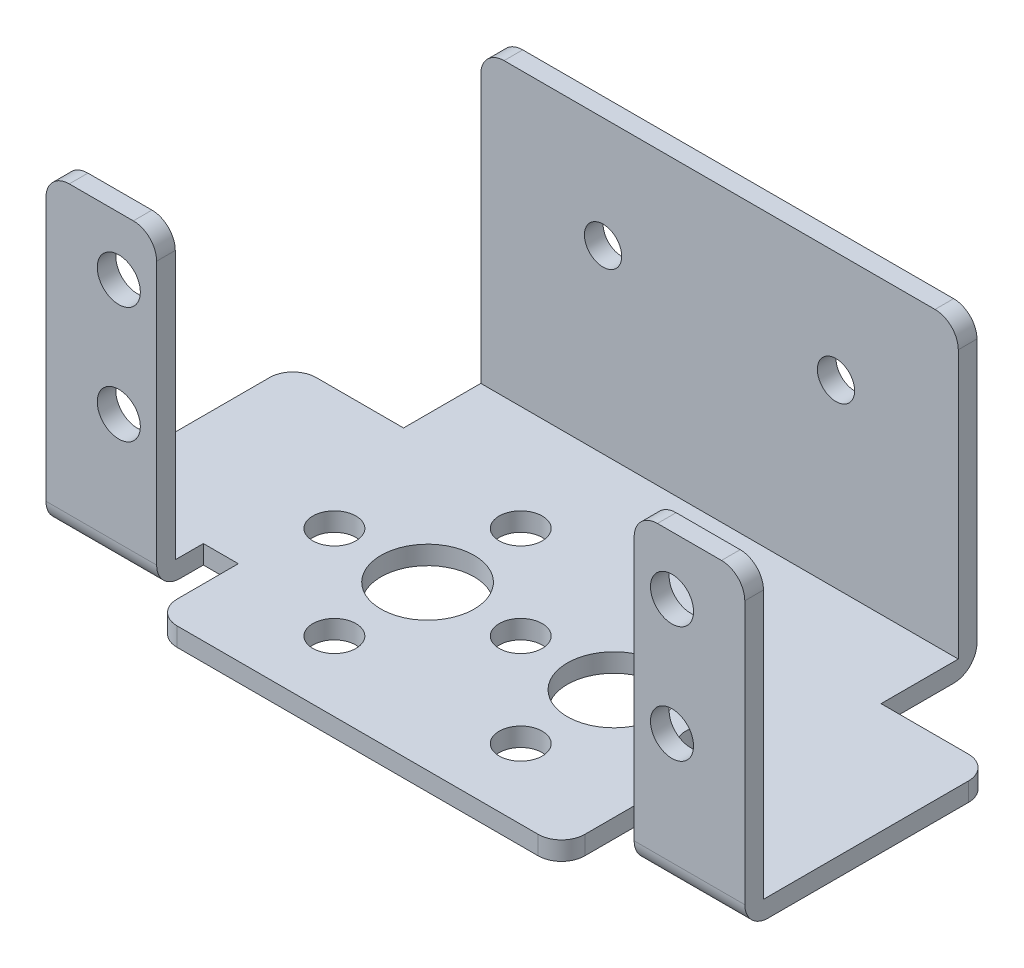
ISO-10303-21;
HEADER;
FILE_DESCRIPTION(('STEP AP214'),'2;1');
FILE_NAME('part.step','',(''),(''),'','','');
FILE_SCHEMA(('AUTOMOTIVE_DESIGN { 1 0 10303 214 1 1 1 1 }'));
ENDSEC;
DATA;
#1=APPLICATION_CONTEXT('core data for automotive mechanical design processes');
#2=APPLICATION_PROTOCOL_DEFINITION('international standard','automotive_design',2000,#1);
#3=PRODUCT_CONTEXT('',#1,'mechanical');
#4=PRODUCT('Part','Part','',(#3));
#5=PRODUCT_RELATED_PRODUCT_CATEGORY('part','',(#4));
#6=PRODUCT_DEFINITION_FORMATION('','',#4);
#7=PRODUCT_DEFINITION_CONTEXT('part definition',#1,'design');
#8=PRODUCT_DEFINITION('design','',#6,#7);
#9=PRODUCT_DEFINITION_SHAPE('','',#8);
#10=(LENGTH_UNIT() NAMED_UNIT(*) SI_UNIT(.MILLI.,.METRE.));
#11=(NAMED_UNIT(*) PLANE_ANGLE_UNIT() SI_UNIT($,.RADIAN.));
#12=(NAMED_UNIT(*) SI_UNIT($,.STERADIAN.) SOLID_ANGLE_UNIT());
#13=UNCERTAINTY_MEASURE_WITH_UNIT(LENGTH_MEASURE(1.E-05),#10,'distance_accuracy_value','');
#14=(GEOMETRIC_REPRESENTATION_CONTEXT(3) GLOBAL_UNCERTAINTY_ASSIGNED_CONTEXT((#13)) GLOBAL_UNIT_ASSIGNED_CONTEXT((#10,
#11,#12)) REPRESENTATION_CONTEXT('',''));
#15=CARTESIAN_POINT('',(0.,0.,0.));
#16=DIRECTION('',(0.,0.,1.));
#17=DIRECTION('',(1.,0.,0.));
#18=AXIS2_PLACEMENT_3D('',#15,#16,#17);
#19=CARTESIAN_POINT('',(0.,1.6,0.));
#20=DIRECTION('',(0.,-1.,0.));
#21=DIRECTION('',(0.,0.,-1.));
#22=AXIS2_PLACEMENT_3D('',#19,#20,#21);
#23=PLANE('',#22);
#24=CARTESIAN_POINT('',(38.,1.6,-2.76112478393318));
#25=DIRECTION('',(0.,-1.,0.));
#26=DIRECTION('',(0.,0.,-1.));
#27=AXIS2_PLACEMENT_3D('',#24,#25,#26);
#28=CIRCLE('',#27,1.85);
#29=CARTESIAN_POINT('',(38.,1.6,-4.61112478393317));
#30=VERTEX_POINT('',#29);
#31=EDGE_CURVE('E1112',#30,#30,#28,.T.);
#32=ORIENTED_EDGE('',*,*,#31,.T.);
#33=EDGE_LOOP('',(#32));
#34=FACE_BOUND('',#33,.T.);
#35=CARTESIAN_POINT('',(38.,1.6,-18.7611247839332));
#36=DIRECTION('',(0.,-1.,0.));
#37=DIRECTION('',(0.,0.,-1.));
#38=AXIS2_PLACEMENT_3D('',#35,#36,#37);
#39=CIRCLE('',#38,1.85);
#40=CARTESIAN_POINT('',(38.,1.6,-20.6111247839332));
#41=VERTEX_POINT('',#40);
#42=EDGE_CURVE('E1116',#41,#41,#39,.T.);
#43=ORIENTED_EDGE('',*,*,#42,.T.);
#44=EDGE_LOOP('',(#43));
#45=FACE_BOUND('',#44,.T.);
#46=CARTESIAN_POINT('',(46.,1.6,-10.7611247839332));
#47=DIRECTION('',(0.,-1.,0.));
#48=DIRECTION('',(0.,0.,-1.));
#49=AXIS2_PLACEMENT_3D('',#46,#47,#48);
#50=CIRCLE('',#49,1.85);
#51=CARTESIAN_POINT('',(46.,1.6,-12.6111247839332));
#52=VERTEX_POINT('',#51);
#53=EDGE_CURVE('E1125',#52,#52,#50,.T.);
#54=ORIENTED_EDGE('',*,*,#53,.T.);
#55=EDGE_LOOP('',(#54));
#56=FACE_BOUND('',#55,.T.);
#57=CARTESIAN_POINT('',(38.,1.6,-10.7611247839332));
#58=DIRECTION('',(0.,-1.,0.));
#59=DIRECTION('',(0.,0.,-1.));
#60=AXIS2_PLACEMENT_3D('',#57,#58,#59);
#61=CIRCLE('',#60,4.);
#62=CARTESIAN_POINT('',(38.,1.6,-14.7611247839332));
#63=VERTEX_POINT('',#62);
#64=EDGE_CURVE('E1131',#63,#63,#61,.T.);
#65=ORIENTED_EDGE('',*,*,#64,.T.);
#66=EDGE_LOOP('',(#65));
#67=FACE_BOUND('',#66,.T.);
#68=CARTESIAN_POINT('',(22.,1.6,-2.76112478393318));
#69=DIRECTION('',(0.,-1.,0.));
#70=DIRECTION('',(0.,0.,-1.));
#71=AXIS2_PLACEMENT_3D('',#68,#69,#70);
#72=CIRCLE('',#71,1.85);
#73=CARTESIAN_POINT('',(22.,1.6,-4.61112478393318));
#74=VERTEX_POINT('',#73);
#75=EDGE_CURVE('E1137',#74,#74,#72,.T.);
#76=ORIENTED_EDGE('',*,*,#75,.T.);
#77=EDGE_LOOP('',(#76));
#78=FACE_BOUND('',#77,.T.);
#79=CARTESIAN_POINT('',(22.,1.6,-18.7611247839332));
#80=DIRECTION('',(0.,-1.,0.));
#81=DIRECTION('',(0.,0.,-1.));
#82=AXIS2_PLACEMENT_3D('',#79,#80,#81);
#83=CIRCLE('',#82,1.85);
#84=CARTESIAN_POINT('',(22.,1.6,-20.6111247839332));
#85=VERTEX_POINT('',#84);
#86=EDGE_CURVE('E1143',#85,#85,#83,.T.);
#87=ORIENTED_EDGE('',*,*,#86,.T.);
#88=EDGE_LOOP('',(#87));
#89=FACE_BOUND('',#88,.T.);
#90=CARTESIAN_POINT('',(30.,1.6,-10.7611247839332));
#91=DIRECTION('',(0.,-1.,0.));
#92=DIRECTION('',(0.,0.,-1.));
#93=AXIS2_PLACEMENT_3D('',#90,#91,#92);
#94=CIRCLE('',#93,1.85);
#95=CARTESIAN_POINT('',(30.,1.6,-12.6111247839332));
#96=VERTEX_POINT('',#95);
#97=EDGE_CURVE('E1149',#96,#96,#94,.T.);
#98=ORIENTED_EDGE('',*,*,#97,.T.);
#99=EDGE_LOOP('',(#98));
#100=FACE_BOUND('',#99,.T.);
#101=CARTESIAN_POINT('',(22.,1.6,-10.7611247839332));
#102=DIRECTION('',(0.,-1.,0.));
#103=DIRECTION('',(0.,0.,-1.));
#104=AXIS2_PLACEMENT_3D('',#101,#102,#103);
#105=CIRCLE('',#104,4.);
#106=CARTESIAN_POINT('',(22.,1.6,-14.7611247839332));
#107=VERTEX_POINT('',#106);
#108=EDGE_CURVE('E1155',#107,#107,#105,.T.);
#109=ORIENTED_EDGE('',*,*,#108,.T.);
#110=EDGE_LOOP('',(#109));
#111=FACE_BOUND('',#110,.T.);
#112=CARTESIAN_POINT('',(14.,1.6,-10.7611247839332));
#113=DIRECTION('',(0.,-1.,0.));
#114=DIRECTION('',(0.,0.,-1.));
#115=AXIS2_PLACEMENT_3D('',#112,#113,#114);
#116=CIRCLE('',#115,1.85);
#117=CARTESIAN_POINT('',(14.,1.6,-12.6111247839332));
#118=VERTEX_POINT('',#117);
#119=EDGE_CURVE('E1161',#118,#118,#116,.T.);
#120=ORIENTED_EDGE('',*,*,#119,.T.);
#121=EDGE_LOOP('',(#120));
#122=FACE_BOUND('',#121,.T.);
#123=DIRECTION('',(0.,0.,-1.));
#124=VECTOR('',#123,1.);
#125=CARTESIAN_POINT('',(60.,1.6,-21.2));
#126=LINE('',#125,#124);
#127=CARTESIAN_POINT('',(60.,1.6,-1.6));
#128=VERTEX_POINT('',#127);
#129=CARTESIAN_POINT('',(60.,1.6,-19.2));
#130=VERTEX_POINT('',#129);
#131=EDGE_CURVE('E530',#128,#130,#126,.T.);
#132=ORIENTED_EDGE('',*,*,#131,.T.);
#133=CARTESIAN_POINT('',(58.,1.6,-19.2));
#134=DIRECTION('',(0.,-1.,0.));
#135=DIRECTION('',(0.,0.,-1.));
#136=AXIS2_PLACEMENT_3D('',#133,#134,#135);
#137=CIRCLE('',#136,2.);
#138=CARTESIAN_POINT('',(58.,1.6,-21.2));
#139=VERTEX_POINT('',#138);
#140=EDGE_CURVE('E537',#130,#139,#137,.F.);
#141=ORIENTED_EDGE('',*,*,#140,.T.);
#142=DIRECTION('',(-1.,0.,0.));
#143=VECTOR('',#142,1.);
#144=CARTESIAN_POINT('',(50.5,1.6,-21.2));
#145=LINE('',#144,#143);
#146=CARTESIAN_POINT('',(50.5,1.6,-21.2));
#147=VERTEX_POINT('',#146);
#148=EDGE_CURVE('E532',#139,#147,#145,.T.);
#149=ORIENTED_EDGE('',*,*,#148,.T.);
#150=DIRECTION('',(0.,0.,-1.));
#151=VECTOR('',#150,1.);
#152=CARTESIAN_POINT('',(50.5,1.6,-29.4306938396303));
#153=LINE('',#152,#151);
#154=CARTESIAN_POINT('',(50.5,1.6,-27.8306938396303));
#155=VERTEX_POINT('',#154);
#156=EDGE_CURVE('E280',#147,#155,#153,.T.);
#157=ORIENTED_EDGE('',*,*,#156,.T.);
#158=DIRECTION('',(1.,0.,0.));
#159=VECTOR('',#158,1.);
#160=CARTESIAN_POINT('',(9.5,1.6,-27.8306938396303));
#161=LINE('',#160,#159);
#162=CARTESIAN_POINT('',(9.5,1.6,-27.8306938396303));
#163=VERTEX_POINT('',#162);
#164=EDGE_CURVE('E263',#163,#155,#161,.T.);
#165=ORIENTED_EDGE('',*,*,#164,.F.);
#166=DIRECTION('',(0.,0.,1.));
#167=VECTOR('',#166,1.);
#168=CARTESIAN_POINT('',(9.5,1.6,-21.2));
#169=LINE('',#168,#167);
#170=CARTESIAN_POINT('',(9.5,1.6,-21.2));
#171=VERTEX_POINT('',#170);
#172=EDGE_CURVE('E271',#163,#171,#169,.T.);
#173=ORIENTED_EDGE('',*,*,#172,.T.);
#174=DIRECTION('',(-1.,0.,0.));
#175=VECTOR('',#174,1.);
#176=CARTESIAN_POINT('',(0.,1.6,-21.2));
#177=LINE('',#176,#175);
#178=CARTESIAN_POINT('',(2.,1.6,-21.2));
#179=VERTEX_POINT('',#178);
#180=EDGE_CURVE('E279',#171,#179,#177,.T.);
#181=ORIENTED_EDGE('',*,*,#180,.T.);
#182=CARTESIAN_POINT('',(2.,1.6,-19.2));
#183=DIRECTION('',(0.,-1.,0.));
#184=DIRECTION('',(0.,0.,-1.));
#185=AXIS2_PLACEMENT_3D('',#182,#183,#184);
#186=CIRCLE('',#185,2.);
#187=CARTESIAN_POINT('',(0.,1.6,-19.2));
#188=VERTEX_POINT('',#187);
#189=EDGE_CURVE('E1231',#179,#188,#186,.F.);
#190=ORIENTED_EDGE('',*,*,#189,.T.);
#191=DIRECTION('',(0.,0.,1.));
#192=VECTOR('',#191,1.);
#193=CARTESIAN_POINT('',(0.,1.6,0.));
#194=LINE('',#193,#192);
#195=CARTESIAN_POINT('',(0.,1.6,-1.6));
#196=VERTEX_POINT('',#195);
#197=EDGE_CURVE('E347',#188,#196,#194,.T.);
#198=ORIENTED_EDGE('',*,*,#197,.T.);
#199=DIRECTION('',(-1.,0.,0.));
#200=VECTOR('',#199,1.);
#201=CARTESIAN_POINT('',(0.,1.6,-1.6));
#202=LINE('',#201,#200);
#203=CARTESIAN_POINT('',(9.5,1.6,-1.6));
#204=VERTEX_POINT('',#203);
#205=EDGE_CURVE('E307',#204,#196,#202,.T.);
#206=ORIENTED_EDGE('',*,*,#205,.F.);
#207=DIRECTION('',(0.,0.,-1.));
#208=VECTOR('',#207,1.);
#209=CARTESIAN_POINT('',(9.5,1.6,-4.01197411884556));
#210=LINE('',#209,#208);
#211=CARTESIAN_POINT('',(9.5,1.6,-4.01197411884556));
#212=VERTEX_POINT('',#211);
#213=EDGE_CURVE('E322',#204,#212,#210,.T.);
#214=ORIENTED_EDGE('',*,*,#213,.T.);
#215=DIRECTION('',(1.,0.,0.));
#216=VECTOR('',#215,1.);
#217=CARTESIAN_POINT('',(12.5,1.6,-4.01197411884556));
#218=LINE('',#217,#216);
#219=CARTESIAN_POINT('',(12.5,1.6,-4.01197411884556));
#220=VERTEX_POINT('',#219);
#221=EDGE_CURVE('E515',#212,#220,#218,.T.);
#222=ORIENTED_EDGE('',*,*,#221,.T.);
#223=DIRECTION('',(0.,0.,1.));
#224=VECTOR('',#223,1.);
#225=CARTESIAN_POINT('',(12.5,1.6,3.23887521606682));
#226=LINE('',#225,#224);
#227=CARTESIAN_POINT('',(12.5,1.6,1.23887521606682));
#228=VERTEX_POINT('',#227);
#229=EDGE_CURVE('E516',#220,#228,#226,.T.);
#230=ORIENTED_EDGE('',*,*,#229,.T.);
#231=CARTESIAN_POINT('',(14.5,1.6,1.23887521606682));
#232=DIRECTION('',(0.,-1.,0.));
#233=DIRECTION('',(0.,0.,-1.));
#234=AXIS2_PLACEMENT_3D('',#231,#232,#233);
#235=CIRCLE('',#234,2.);
#236=CARTESIAN_POINT('',(14.5,1.6,3.23887521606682));
#237=VERTEX_POINT('',#236);
#238=EDGE_CURVE('E441',#228,#237,#235,.F.);
#239=ORIENTED_EDGE('',*,*,#238,.T.);
#240=DIRECTION('',(1.,0.,0.));
#241=VECTOR('',#240,1.);
#242=CARTESIAN_POINT('',(47.5,1.6,3.23887521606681));
#243=LINE('',#242,#241);
#244=CARTESIAN_POINT('',(45.5,1.6,3.23887521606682));
#245=VERTEX_POINT('',#244);
#246=EDGE_CURVE('E519',#237,#245,#243,.T.);
#247=ORIENTED_EDGE('',*,*,#246,.T.);
#248=CARTESIAN_POINT('',(45.5,1.6,1.23887521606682));
#249=DIRECTION('',(0.,-1.,0.));
#250=DIRECTION('',(0.,0.,-1.));
#251=AXIS2_PLACEMENT_3D('',#248,#249,#250);
#252=CIRCLE('',#251,2.);
#253=CARTESIAN_POINT('',(47.5,1.6,1.23887521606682));
#254=VERTEX_POINT('',#253);
#255=EDGE_CURVE('E432',#245,#254,#252,.F.);
#256=ORIENTED_EDGE('',*,*,#255,.T.);
#257=DIRECTION('',(0.,0.,-1.));
#258=VECTOR('',#257,1.);
#259=CARTESIAN_POINT('',(47.5,1.6,-4.01197411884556));
#260=LINE('',#259,#258);
#261=CARTESIAN_POINT('',(47.5,1.6,-4.01197411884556));
#262=VERTEX_POINT('',#261);
#263=EDGE_CURVE('E523',#254,#262,#260,.T.);
#264=ORIENTED_EDGE('',*,*,#263,.T.);
#265=DIRECTION('',(1.,0.,0.));
#266=VECTOR('',#265,1.);
#267=CARTESIAN_POINT('',(50.5,1.6,-4.01197411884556));
#268=LINE('',#267,#266);
#269=CARTESIAN_POINT('',(50.5,1.6,-4.01197411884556));
#270=VERTEX_POINT('',#269);
#271=EDGE_CURVE('E525',#262,#270,#268,.T.);
#272=ORIENTED_EDGE('',*,*,#271,.T.);
#273=DIRECTION('',(0.,0.,1.));
#274=VECTOR('',#273,1.);
#275=CARTESIAN_POINT('',(50.5,1.6,0.));
#276=LINE('',#275,#274);
#277=CARTESIAN_POINT('',(50.5,1.6,-1.6));
#278=VERTEX_POINT('',#277);
#279=EDGE_CURVE('E527',#270,#278,#276,.T.);
#280=ORIENTED_EDGE('',*,*,#279,.T.);
#281=DIRECTION('',(-1.,0.,0.));
#282=VECTOR('',#281,1.);
#283=CARTESIAN_POINT('',(50.5,1.6,-1.6));
#284=LINE('',#283,#282);
#285=EDGE_CURVE('E267',#128,#278,#284,.T.);
#286=ORIENTED_EDGE('',*,*,#285,.F.);
#287=EDGE_LOOP('',(#132,#141,#149,#157,#165,#173,#181,#190,#198,#206,#214,#222,#230,#239,#247,
#256,#264,#272,#280,#286));
#288=FACE_BOUND('',#287,.T.);
#289=ADVANCED_FACE('F31',(#34,#45,#56,#67,#78,#89,#100,#111,#122,#288),#23,.F.);
#290=CARTESIAN_POINT('',(9.5,1.6,0.));
#291=DIRECTION('',(0.,0.,-1.));
#292=DIRECTION('',(-1.,0.,0.));
#293=AXIS2_PLACEMENT_3D('',#290,#291,#292);
#294=PLANE('',#293);
#295=CARTESIAN_POINT('',(6.25,11.6,0.));
#296=DIRECTION('',(0.,0.,1.));
#297=DIRECTION('',(1.,0.,0.));
#298=AXIS2_PLACEMENT_3D('',#295,#296,#297);
#299=CIRCLE('',#298,1.85);
#300=CARTESIAN_POINT('',(8.1,11.6,0.));
#301=VERTEX_POINT('',#300);
#302=EDGE_CURVE('E1183',#301,#301,#299,.T.);
#303=ORIENTED_EDGE('',*,*,#302,.F.);
#304=EDGE_LOOP('',(#303));
#305=FACE_BOUND('',#304,.T.);
#306=CARTESIAN_POINT('',(6.24999999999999,21.6,0.));
#307=DIRECTION('',(0.,0.,1.));
#308=DIRECTION('',(1.,0.,0.));
#309=AXIS2_PLACEMENT_3D('',#306,#307,#308);
#310=CIRCLE('',#309,1.85);
#311=CARTESIAN_POINT('',(8.09999999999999,21.6,0.));
#312=VERTEX_POINT('',#311);
#313=EDGE_CURVE('E291',#312,#312,#310,.T.);
#314=ORIENTED_EDGE('',*,*,#313,.F.);
#315=EDGE_LOOP('',(#314));
#316=FACE_BOUND('',#315,.T.);
#317=DIRECTION('',(0.,-1.,0.));
#318=VECTOR('',#317,1.);
#319=CARTESIAN_POINT('',(0.,1.6,0.));
#320=LINE('',#319,#318);
#321=CARTESIAN_POINT('',(0.,24.6,0.));
#322=VERTEX_POINT('',#321);
#323=CARTESIAN_POINT('',(0.,2.,0.));
#324=VERTEX_POINT('',#323);
#325=EDGE_CURVE('E350',#322,#324,#320,.T.);
#326=ORIENTED_EDGE('',*,*,#325,.T.);
#327=DIRECTION('',(1.,0.,0.));
#328=VECTOR('',#327,1.);
#329=CARTESIAN_POINT('',(9.5,2.,0.));
#330=LINE('',#329,#328);
#331=CARTESIAN_POINT('',(9.5,2.,0.));
#332=VERTEX_POINT('',#331);
#333=EDGE_CURVE('E590',#324,#332,#330,.T.);
#334=ORIENTED_EDGE('',*,*,#333,.T.);
#335=DIRECTION('',(0.,-1.,0.));
#336=VECTOR('',#335,1.);
#337=CARTESIAN_POINT('',(9.5,1.6,0.));
#338=LINE('',#337,#336);
#339=CARTESIAN_POINT('',(9.5,24.6,0.));
#340=VERTEX_POINT('',#339);
#341=EDGE_CURVE('E413',#340,#332,#338,.T.);
#342=ORIENTED_EDGE('',*,*,#341,.F.);
#343=CARTESIAN_POINT('',(7.5,24.6,0.));
#344=DIRECTION('',(0.,0.,-1.));
#345=DIRECTION('',(-1.,0.,0.));
#346=AXIS2_PLACEMENT_3D('',#343,#344,#345);
#347=CIRCLE('',#346,2.);
#348=CARTESIAN_POINT('',(7.5,26.6,0.));
#349=VERTEX_POINT('',#348);
#350=EDGE_CURVE('E461',#340,#349,#347,.F.);
#351=ORIENTED_EDGE('',*,*,#350,.T.);
#352=DIRECTION('',(1.,0.,0.));
#353=VECTOR('',#352,1.);
#354=CARTESIAN_POINT('',(0.,26.6,0.));
#355=LINE('',#354,#353);
#356=CARTESIAN_POINT('',(2.,26.6,0.));
#357=VERTEX_POINT('',#356);
#358=EDGE_CURVE('E308',#357,#349,#355,.T.);
#359=ORIENTED_EDGE('',*,*,#358,.F.);
#360=CARTESIAN_POINT('',(2.,24.6,0.));
#361=DIRECTION('',(0.,0.,-1.));
#362=DIRECTION('',(-1.,0.,0.));
#363=AXIS2_PLACEMENT_3D('',#360,#361,#362);
#364=CIRCLE('',#363,2.);
#365=EDGE_CURVE('E332',#357,#322,#364,.F.);
#366=ORIENTED_EDGE('',*,*,#365,.T.);
#367=EDGE_LOOP('',(#326,#334,#342,#351,#359,#366));
#368=FACE_BOUND('',#367,.T.);
#369=ADVANCED_FACE('F489',(#305,#316,#368),#294,.F.);
#370=CARTESIAN_POINT('',(9.5,1.6,-4.01197411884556));
#371=DIRECTION('',(-1.,0.,0.));
#372=DIRECTION('',(0.,0.,1.));
#373=AXIS2_PLACEMENT_3D('',#370,#371,#372);
#374=PLANE('',#373);
#375=ORIENTED_EDGE('',*,*,#341,.T.);
#376=CARTESIAN_POINT('',(9.5,2.,-2.));
#377=DIRECTION('',(-1.,0.,0.));
#378=DIRECTION('',(0.,0.,1.));
#379=AXIS2_PLACEMENT_3D('',#376,#377,#378);
#380=CIRCLE('',#379,2.);
#381=CARTESIAN_POINT('',(9.5,0.,-2.));
#382=VERTEX_POINT('',#381);
#383=EDGE_CURVE('E53',#332,#382,#380,.F.);
#384=ORIENTED_EDGE('',*,*,#383,.T.);
#385=DIRECTION('',(0.,0.,-1.));
#386=VECTOR('',#385,1.);
#387=CARTESIAN_POINT('',(9.5,0.,-4.01197411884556));
#388=LINE('',#387,#386);
#389=CARTESIAN_POINT('',(9.5,0.,-4.01197411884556));
#390=VERTEX_POINT('',#389);
#391=EDGE_CURVE('E355',#382,#390,#388,.T.);
#392=ORIENTED_EDGE('',*,*,#391,.T.);
#393=DIRECTION('',(0.,-1.,0.));
#394=VECTOR('',#393,1.);
#395=CARTESIAN_POINT('',(9.5,1.6,-4.01197411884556));
#396=LINE('',#395,#394);
#397=EDGE_CURVE('E411',#212,#390,#396,.T.);
#398=ORIENTED_EDGE('',*,*,#397,.F.);
#399=ORIENTED_EDGE('',*,*,#213,.F.);
#400=DIRECTION('',(0.,-1.,0.));
#401=VECTOR('',#400,1.);
#402=CARTESIAN_POINT('',(9.5,26.6,-1.6));
#403=LINE('',#402,#401);
#404=CARTESIAN_POINT('',(9.5,24.6,-1.6));
#405=VERTEX_POINT('',#404);
#406=EDGE_CURVE('E331',#405,#204,#403,.T.);
#407=ORIENTED_EDGE('',*,*,#406,.F.);
#408=DIRECTION('',(0.,0.,-1.));
#409=VECTOR('',#408,1.);
#410=CARTESIAN_POINT('',(9.5,24.6,-4.01197411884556));
#411=LINE('',#410,#409);
#412=EDGE_CURVE('E459',#405,#340,#411,.F.);
#413=ORIENTED_EDGE('',*,*,#412,.T.);
#414=EDGE_LOOP('',(#375,#384,#392,#398,#399,#407,#413));
#415=FACE_BOUND('',#414,.T.);
#416=ADVANCED_FACE('F512',(#415),#374,.F.);
#417=CARTESIAN_POINT('',(12.5,1.6,-4.01197411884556));
#418=DIRECTION('',(0.,0.,-1.));
#419=DIRECTION('',(-1.,0.,0.));
#420=AXIS2_PLACEMENT_3D('',#417,#418,#419);
#421=PLANE('',#420);
#422=DIRECTION('',(1.,0.,0.));
#423=VECTOR('',#422,1.);
#424=CARTESIAN_POINT('',(12.5,0.,-4.01197411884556));
#425=LINE('',#424,#423);
#426=CARTESIAN_POINT('',(12.5,0.,-4.01197411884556));
#427=VERTEX_POINT('',#426);
#428=EDGE_CURVE('E357',#390,#427,#425,.T.);
#429=ORIENTED_EDGE('',*,*,#428,.T.);
#430=DIRECTION('',(0.,-1.,0.));
#431=VECTOR('',#430,1.);
#432=CARTESIAN_POINT('',(12.5,1.6,-4.01197411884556));
#433=LINE('',#432,#431);
#434=EDGE_CURVE('E408',#220,#427,#433,.T.);
#435=ORIENTED_EDGE('',*,*,#434,.F.);
#436=ORIENTED_EDGE('',*,*,#221,.F.);
#437=ORIENTED_EDGE('',*,*,#397,.T.);
#438=EDGE_LOOP('',(#429,#435,#436,#437));
#439=FACE_BOUND('',#438,.T.);
#440=ADVANCED_FACE('F656',(#439),#421,.F.);
#441=CARTESIAN_POINT('',(12.5,1.6,3.23887521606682));
#442=DIRECTION('',(1.,0.,0.));
#443=DIRECTION('',(0.,0.,-1.));
#444=AXIS2_PLACEMENT_3D('',#441,#442,#443);
#445=PLANE('',#444);
#446=DIRECTION('',(0.,0.,1.));
#447=VECTOR('',#446,1.);
#448=CARTESIAN_POINT('',(12.5,0.,3.23887521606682));
#449=LINE('',#448,#447);
#450=CARTESIAN_POINT('',(12.5,0.,1.23887521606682));
#451=VERTEX_POINT('',#450);
#452=EDGE_CURVE('E359',#427,#451,#449,.T.);
#453=ORIENTED_EDGE('',*,*,#452,.T.);
#454=DIRECTION('',(0.,-1.,0.));
#455=VECTOR('',#454,1.);
#456=CARTESIAN_POINT('',(12.5,1.6,1.23887521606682));
#457=LINE('',#456,#455);
#458=EDGE_CURVE('E439',#451,#228,#457,.F.);
#459=ORIENTED_EDGE('',*,*,#458,.T.);
#460=ORIENTED_EDGE('',*,*,#229,.F.);
#461=ORIENTED_EDGE('',*,*,#434,.T.);
#462=EDGE_LOOP('',(#453,#459,#460,#461));
#463=FACE_BOUND('',#462,.T.);
#464=ADVANCED_FACE('F652',(#463),#445,.F.);
#465=CARTESIAN_POINT('',(47.5,1.6,3.23887521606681));
#466=DIRECTION('',(0.,0.,-1.));
#467=DIRECTION('',(-1.,0.,0.));
#468=AXIS2_PLACEMENT_3D('',#465,#466,#467);
#469=PLANE('',#468);
#470=ORIENTED_EDGE('',*,*,#246,.F.);
#471=DIRECTION('',(0.,-1.,0.));
#472=VECTOR('',#471,1.);
#473=CARTESIAN_POINT('',(14.5,1.6,3.23887521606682));
#474=LINE('',#473,#472);
#475=CARTESIAN_POINT('',(14.5,0.,3.23887521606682));
#476=VERTEX_POINT('',#475);
#477=EDGE_CURVE('E434',#237,#476,#474,.T.);
#478=ORIENTED_EDGE('',*,*,#477,.T.);
#479=DIRECTION('',(1.,0.,0.));
#480=VECTOR('',#479,1.);
#481=CARTESIAN_POINT('',(47.5,0.,3.23887521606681));
#482=LINE('',#481,#480);
#483=CARTESIAN_POINT('',(45.5,0.,3.23887521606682));
#484=VERTEX_POINT('',#483);
#485=EDGE_CURVE('E362',#476,#484,#482,.T.);
#486=ORIENTED_EDGE('',*,*,#485,.T.);
#487=DIRECTION('',(0.,-1.,0.));
#488=VECTOR('',#487,1.);
#489=CARTESIAN_POINT('',(45.5,1.6,3.23887521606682));
#490=LINE('',#489,#488);
#491=EDGE_CURVE('E424',#484,#245,#490,.F.);
#492=ORIENTED_EDGE('',*,*,#491,.T.);
#493=EDGE_LOOP('',(#470,#478,#486,#492));
#494=FACE_BOUND('',#493,.T.);
#495=ADVANCED_FACE('F649',(#494),#469,.F.);
#496=CARTESIAN_POINT('',(47.5,1.6,-4.01197411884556));
#497=DIRECTION('',(-1.,0.,0.));
#498=DIRECTION('',(0.,0.,1.));
#499=AXIS2_PLACEMENT_3D('',#496,#497,#498);
#500=PLANE('',#499);
#501=ORIENTED_EDGE('',*,*,#263,.F.);
#502=DIRECTION('',(0.,-1.,0.));
#503=VECTOR('',#502,1.);
#504=CARTESIAN_POINT('',(47.5,1.6,1.23887521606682));
#505=LINE('',#504,#503);
#506=CARTESIAN_POINT('',(47.5,0.,1.23887521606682));
#507=VERTEX_POINT('',#506);
#508=EDGE_CURVE('E414',#254,#507,#505,.T.);
#509=ORIENTED_EDGE('',*,*,#508,.T.);
#510=DIRECTION('',(0.,0.,-1.));
#511=VECTOR('',#510,1.);
#512=CARTESIAN_POINT('',(47.5,0.,-4.01197411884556));
#513=LINE('',#512,#511);
#514=CARTESIAN_POINT('',(47.5,0.,-4.01197411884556));
#515=VERTEX_POINT('',#514);
#516=EDGE_CURVE('E364',#507,#515,#513,.T.);
#517=ORIENTED_EDGE('',*,*,#516,.T.);
#518=DIRECTION('',(0.,-1.,0.));
#519=VECTOR('',#518,1.);
#520=CARTESIAN_POINT('',(47.5,1.6,-4.01197411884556));
#521=LINE('',#520,#519);
#522=EDGE_CURVE('E405',#262,#515,#521,.T.);
#523=ORIENTED_EDGE('',*,*,#522,.F.);
#524=EDGE_LOOP('',(#501,#509,#517,#523));
#525=FACE_BOUND('',#524,.T.);
#526=ADVANCED_FACE('F645',(#525),#500,.F.);
#527=CARTESIAN_POINT('',(50.5,1.6,-4.01197411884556));
#528=DIRECTION('',(0.,0.,-1.));
#529=DIRECTION('',(-1.,0.,0.));
#530=AXIS2_PLACEMENT_3D('',#527,#528,#529);
#531=PLANE('',#530);
#532=DIRECTION('',(1.,0.,0.));
#533=VECTOR('',#532,1.);
#534=CARTESIAN_POINT('',(50.5,0.,-4.01197411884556));
#535=LINE('',#534,#533);
#536=CARTESIAN_POINT('',(50.5,0.,-4.01197411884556));
#537=VERTEX_POINT('',#536);
#538=EDGE_CURVE('E366',#515,#537,#535,.T.);
#539=ORIENTED_EDGE('',*,*,#538,.T.);
#540=DIRECTION('',(0.,-1.,0.));
#541=VECTOR('',#540,1.);
#542=CARTESIAN_POINT('',(50.5,1.6,-4.01197411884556));
#543=LINE('',#542,#541);
#544=EDGE_CURVE('E402',#270,#537,#543,.T.);
#545=ORIENTED_EDGE('',*,*,#544,.F.);
#546=ORIENTED_EDGE('',*,*,#271,.F.);
#547=ORIENTED_EDGE('',*,*,#522,.T.);
#548=EDGE_LOOP('',(#539,#545,#546,#547));
#549=FACE_BOUND('',#548,.T.);
#550=ADVANCED_FACE('F641',(#549),#531,.F.);
#551=CARTESIAN_POINT('',(50.5,1.6,0.));
#552=DIRECTION('',(1.,0.,0.));
#553=DIRECTION('',(0.,0.,-1.));
#554=AXIS2_PLACEMENT_3D('',#551,#552,#553);
#555=PLANE('',#554);
#556=DIRECTION('',(0.,0.,1.));
#557=VECTOR('',#556,1.);
#558=CARTESIAN_POINT('',(50.5,0.,0.));
#559=LINE('',#558,#557);
#560=CARTESIAN_POINT('',(50.5,0.,-2.));
#561=VERTEX_POINT('',#560);
#562=EDGE_CURVE('E368',#537,#561,#559,.T.);
#563=ORIENTED_EDGE('',*,*,#562,.T.);
#564=CARTESIAN_POINT('',(50.5,2.,-2.));
#565=DIRECTION('',(1.,0.,0.));
#566=DIRECTION('',(0.,0.,-1.));
#567=AXIS2_PLACEMENT_3D('',#564,#565,#566);
#568=CIRCLE('',#567,2.);
#569=CARTESIAN_POINT('',(50.5,2.,0.));
#570=VERTEX_POINT('',#569);
#571=EDGE_CURVE('E588',#561,#570,#568,.F.);
#572=ORIENTED_EDGE('',*,*,#571,.T.);
#573=DIRECTION('',(0.,-1.,0.));
#574=VECTOR('',#573,1.);
#575=CARTESIAN_POINT('',(50.5,1.6,0.));
#576=LINE('',#575,#574);
#577=CARTESIAN_POINT('',(50.5,24.6,0.));
#578=VERTEX_POINT('',#577);
#579=EDGE_CURVE('E399',#578,#570,#576,.T.);
#580=ORIENTED_EDGE('',*,*,#579,.F.);
#581=DIRECTION('',(0.,0.,1.));
#582=VECTOR('',#581,1.);
#583=CARTESIAN_POINT('',(50.5,24.6,0.));
#584=LINE('',#583,#582);
#585=CARTESIAN_POINT('',(50.5,24.6,-1.6));
#586=VERTEX_POINT('',#585);
#587=EDGE_CURVE('E479',#578,#586,#584,.F.);
#588=ORIENTED_EDGE('',*,*,#587,.T.);
#589=DIRECTION('',(0.,-1.,0.));
#590=VECTOR('',#589,1.);
#591=CARTESIAN_POINT('',(50.5,26.6,-1.6));
#592=LINE('',#591,#590);
#593=EDGE_CURVE('E301',#586,#278,#592,.T.);
#594=ORIENTED_EDGE('',*,*,#593,.T.);
#595=ORIENTED_EDGE('',*,*,#279,.F.);
#596=ORIENTED_EDGE('',*,*,#544,.T.);
#597=EDGE_LOOP('',(#563,#572,#580,#588,#594,#595,#596));
#598=FACE_BOUND('',#597,.T.);
#599=ADVANCED_FACE('F637',(#598),#555,.F.);
#600=CARTESIAN_POINT('',(60.,1.6,0.));
#601=DIRECTION('',(0.,0.,-1.));
#602=DIRECTION('',(-1.,0.,0.));
#603=AXIS2_PLACEMENT_3D('',#600,#601,#602);
#604=PLANE('',#603);
#605=CARTESIAN_POINT('',(53.75,11.6,0.));
#606=DIRECTION('',(0.,0.,1.));
#607=DIRECTION('',(1.,0.,0.));
#608=AXIS2_PLACEMENT_3D('',#605,#606,#607);
#609=CIRCLE('',#608,1.85);
#610=CARTESIAN_POINT('',(55.6,11.6,0.));
#611=VERTEX_POINT('',#610);
#612=EDGE_CURVE('E1176',#611,#611,#609,.T.);
#613=ORIENTED_EDGE('',*,*,#612,.F.);
#614=EDGE_LOOP('',(#613));
#615=FACE_BOUND('',#614,.T.);
#616=CARTESIAN_POINT('',(53.75,21.6,0.));
#617=DIRECTION('',(0.,0.,1.));
#618=DIRECTION('',(1.,0.,0.));
#619=AXIS2_PLACEMENT_3D('',#616,#617,#618);
#620=CIRCLE('',#619,1.85);
#621=CARTESIAN_POINT('',(55.6,21.6,0.));
#622=VERTEX_POINT('',#621);
#623=EDGE_CURVE('E1179',#622,#622,#620,.T.);
#624=ORIENTED_EDGE('',*,*,#623,.F.);
#625=EDGE_LOOP('',(#624));
#626=FACE_BOUND('',#625,.T.);
#627=ORIENTED_EDGE('',*,*,#579,.T.);
#628=DIRECTION('',(1.,0.,0.));
#629=VECTOR('',#628,1.);
#630=CARTESIAN_POINT('',(60.,2.,0.));
#631=LINE('',#630,#629);
#632=CARTESIAN_POINT('',(60.,2.,0.));
#633=VERTEX_POINT('',#632);
#634=EDGE_CURVE('E578',#570,#633,#631,.T.);
#635=ORIENTED_EDGE('',*,*,#634,.T.);
#636=DIRECTION('',(0.,-1.,0.));
#637=VECTOR('',#636,1.);
#638=CARTESIAN_POINT('',(60.,1.6,0.));
#639=LINE('',#638,#637);
#640=CARTESIAN_POINT('',(60.,24.6,0.));
#641=VERTEX_POINT('',#640);
#642=EDGE_CURVE('E396',#641,#633,#639,.T.);
#643=ORIENTED_EDGE('',*,*,#642,.F.);
#644=CARTESIAN_POINT('',(58.,24.6,0.));
#645=DIRECTION('',(0.,0.,-1.));
#646=DIRECTION('',(-1.,0.,0.));
#647=AXIS2_PLACEMENT_3D('',#644,#645,#646);
#648=CIRCLE('',#647,2.);
#649=CARTESIAN_POINT('',(58.,26.6,0.));
#650=VERTEX_POINT('',#649);
#651=EDGE_CURVE('E450',#641,#650,#648,.F.);
#652=ORIENTED_EDGE('',*,*,#651,.T.);
#653=DIRECTION('',(1.,0.,0.));
#654=VECTOR('',#653,1.);
#655=CARTESIAN_POINT('',(50.5,26.6,0.));
#656=LINE('',#655,#654);
#657=CARTESIAN_POINT('',(52.5,26.6,0.));
#658=VERTEX_POINT('',#657);
#659=EDGE_CURVE('E296',#658,#650,#656,.T.);
#660=ORIENTED_EDGE('',*,*,#659,.F.);
#661=CARTESIAN_POINT('',(52.5,24.6,0.));
#662=DIRECTION('',(0.,0.,-1.));
#663=DIRECTION('',(-1.,0.,0.));
#664=AXIS2_PLACEMENT_3D('',#661,#662,#663);
#665=CIRCLE('',#664,2.);
#666=EDGE_CURVE('E477',#658,#578,#665,.F.);
#667=ORIENTED_EDGE('',*,*,#666,.T.);
#668=EDGE_LOOP('',(#627,#635,#643,#652,#660,#667));
#669=FACE_BOUND('',#668,.T.);
#670=ADVANCED_FACE('F633',(#615,#626,#669),#604,.F.);
#671=CARTESIAN_POINT('',(60.,1.6,-21.2));
#672=DIRECTION('',(-1.,0.,0.));
#673=DIRECTION('',(0.,0.,1.));
#674=AXIS2_PLACEMENT_3D('',#671,#672,#673);
#675=PLANE('',#674);
#676=ORIENTED_EDGE('',*,*,#642,.T.);
#677=CARTESIAN_POINT('',(60.,2.,-2.));
#678=DIRECTION('',(-1.,0.,0.));
#679=DIRECTION('',(0.,0.,1.));
#680=AXIS2_PLACEMENT_3D('',#677,#678,#679);
#681=CIRCLE('',#680,2.);
#682=CARTESIAN_POINT('',(60.,0.,-2.));
#683=VERTEX_POINT('',#682);
#684=EDGE_CURVE('E584',#633,#683,#681,.F.);
#685=ORIENTED_EDGE('',*,*,#684,.T.);
#686=DIRECTION('',(0.,0.,-1.));
#687=VECTOR('',#686,1.);
#688=CARTESIAN_POINT('',(60.,0.,-21.2));
#689=LINE('',#688,#687);
#690=CARTESIAN_POINT('',(60.,0.,-19.2));
#691=VERTEX_POINT('',#690);
#692=EDGE_CURVE('E371',#683,#691,#689,.T.);
#693=ORIENTED_EDGE('',*,*,#692,.T.);
#694=DIRECTION('',(0.,-1.,0.));
#695=VECTOR('',#694,1.);
#696=CARTESIAN_POINT('',(60.,1.6,-19.2));
#697=LINE('',#696,#695);
#698=EDGE_CURVE('E1214',#691,#130,#697,.F.);
#699=ORIENTED_EDGE('',*,*,#698,.T.);
#700=ORIENTED_EDGE('',*,*,#131,.F.);
#701=DIRECTION('',(0.,-1.,0.));
#702=VECTOR('',#701,1.);
#703=CARTESIAN_POINT('',(60.,26.6,-1.6));
#704=LINE('',#703,#702);
#705=CARTESIAN_POINT('',(60.,24.6,-1.6));
#706=VERTEX_POINT('',#705);
#707=EDGE_CURVE('E305',#706,#128,#704,.T.);
#708=ORIENTED_EDGE('',*,*,#707,.F.);
#709=DIRECTION('',(0.,0.,-1.));
#710=VECTOR('',#709,1.);
#711=CARTESIAN_POINT('',(60.,24.6,-21.2));
#712=LINE('',#711,#710);
#713=EDGE_CURVE('E448',#706,#641,#712,.F.);
#714=ORIENTED_EDGE('',*,*,#713,.T.);
#715=EDGE_LOOP('',(#676,#685,#693,#699,#700,#708,#714));
#716=FACE_BOUND('',#715,.T.);
#717=ADVANCED_FACE('F630',(#716),#675,.F.);
#718=CARTESIAN_POINT('',(50.5,1.6,-21.2));
#719=DIRECTION('',(0.,0.,1.));
#720=DIRECTION('',(1.,0.,0.));
#721=AXIS2_PLACEMENT_3D('',#718,#719,#720);
#722=PLANE('',#721);
#723=ORIENTED_EDGE('',*,*,#148,.F.);
#724=DIRECTION('',(0.,-1.,0.));
#725=VECTOR('',#724,1.);
#726=CARTESIAN_POINT('',(58.,1.6,-21.2));
#727=LINE('',#726,#725);
#728=CARTESIAN_POINT('',(58.,0.,-21.2));
#729=VERTEX_POINT('',#728);
#730=EDGE_CURVE('E1225',#139,#729,#727,.T.);
#731=ORIENTED_EDGE('',*,*,#730,.T.);
#732=DIRECTION('',(-1.,0.,0.));
#733=VECTOR('',#732,1.);
#734=CARTESIAN_POINT('',(50.5,0.,-21.2));
#735=LINE('',#734,#733);
#736=CARTESIAN_POINT('',(50.5,0.,-21.2));
#737=VERTEX_POINT('',#736);
#738=EDGE_CURVE('E373',#729,#737,#735,.T.);
#739=ORIENTED_EDGE('',*,*,#738,.T.);
#740=DIRECTION('',(0.,-1.,0.));
#741=VECTOR('',#740,1.);
#742=CARTESIAN_POINT('',(50.5,1.6,-21.2));
#743=LINE('',#742,#741);
#744=EDGE_CURVE('E393',#147,#737,#743,.T.);
#745=ORIENTED_EDGE('',*,*,#744,.F.);
#746=EDGE_LOOP('',(#723,#731,#739,#745));
#747=FACE_BOUND('',#746,.T.);
#748=ADVANCED_FACE('F541',(#747),#722,.F.);
#749=CARTESIAN_POINT('',(50.5,1.6,-29.4306938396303));
#750=DIRECTION('',(-1.,0.,0.));
#751=DIRECTION('',(0.,0.,1.));
#752=AXIS2_PLACEMENT_3D('',#749,#750,#751);
#753=PLANE('',#752);
#754=DIRECTION('',(0.,0.,-1.));
#755=VECTOR('',#754,1.);
#756=CARTESIAN_POINT('',(50.5,0.,-29.4306938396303));
#757=LINE('',#756,#755);
#758=CARTESIAN_POINT('',(50.5,0.,-27.4306938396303));
#759=VERTEX_POINT('',#758);
#760=EDGE_CURVE('E375',#737,#759,#757,.T.);
#761=ORIENTED_EDGE('',*,*,#760,.T.);
#762=CARTESIAN_POINT('',(50.5,2.,-27.4306938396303));
#763=DIRECTION('',(-1.,0.,0.));
#764=DIRECTION('',(0.,0.,1.));
#765=AXIS2_PLACEMENT_3D('',#762,#763,#764);
#766=CIRCLE('',#765,2.);
#767=CARTESIAN_POINT('',(50.5,2.,-29.4306938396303));
#768=VERTEX_POINT('',#767);
#769=EDGE_CURVE('E576',#759,#768,#766,.F.);
#770=ORIENTED_EDGE('',*,*,#769,.T.);
#771=DIRECTION('',(0.,-1.,0.));
#772=VECTOR('',#771,1.);
#773=CARTESIAN_POINT('',(50.5,1.6,-29.4306938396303));
#774=LINE('',#773,#772);
#775=CARTESIAN_POINT('',(50.5,24.6,-29.4306938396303));
#776=VERTEX_POINT('',#775);
#777=EDGE_CURVE('E390',#776,#768,#774,.T.);
#778=ORIENTED_EDGE('',*,*,#777,.F.);
#779=DIRECTION('',(0.,0.,-1.));
#780=VECTOR('',#779,1.);
#781=CARTESIAN_POINT('',(50.5,24.6,-27.8306938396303));
#782=LINE('',#781,#780);
#783=CARTESIAN_POINT('',(50.5,24.6,-27.8306938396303));
#784=VERTEX_POINT('',#783);
#785=EDGE_CURVE('E469',#776,#784,#782,.F.);
#786=ORIENTED_EDGE('',*,*,#785,.T.);
#787=DIRECTION('',(0.,-1.,0.));
#788=VECTOR('',#787,1.);
#789=CARTESIAN_POINT('',(50.5,26.6,-27.8306938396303));
#790=LINE('',#789,#788);
#791=EDGE_CURVE('E268',#784,#155,#790,.T.);
#792=ORIENTED_EDGE('',*,*,#791,.T.);
#793=ORIENTED_EDGE('',*,*,#156,.F.);
#794=ORIENTED_EDGE('',*,*,#744,.T.);
#795=EDGE_LOOP('',(#761,#770,#778,#786,#792,#793,#794));
#796=FACE_BOUND('',#795,.T.);
#797=ADVANCED_FACE('F545',(#796),#753,.F.);
#798=CARTESIAN_POINT('',(9.5,1.6,-29.4306938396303));
#799=DIRECTION('',(0.,0.,1.));
#800=DIRECTION('',(1.,0.,0.));
#801=AXIS2_PLACEMENT_3D('',#798,#799,#800);
#802=PLANE('',#801);
#803=CARTESIAN_POINT('',(40.,17.0944592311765,-29.4306938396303));
#804=DIRECTION('',(0.,0.,1.));
#805=DIRECTION('',(1.,0.,0.));
#806=AXIS2_PLACEMENT_3D('',#803,#804,#805);
#807=CIRCLE('',#806,1.6);
#808=CARTESIAN_POINT('',(41.6,17.0944592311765,-29.4306938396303));
#809=VERTEX_POINT('',#808);
#810=EDGE_CURVE('E1167',#809,#809,#807,.T.);
#811=ORIENTED_EDGE('',*,*,#810,.T.);
#812=EDGE_LOOP('',(#811));
#813=FACE_BOUND('',#812,.T.);
#814=CARTESIAN_POINT('',(20.,17.0944592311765,-29.4306938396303));
#815=DIRECTION('',(0.,0.,1.));
#816=DIRECTION('',(1.,0.,0.));
#817=AXIS2_PLACEMENT_3D('',#814,#815,#816);
#818=CIRCLE('',#817,1.6);
#819=CARTESIAN_POINT('',(21.6,17.0944592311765,-29.4306938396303));
#820=VERTEX_POINT('',#819);
#821=EDGE_CURVE('E1173',#820,#820,#818,.T.);
#822=ORIENTED_EDGE('',*,*,#821,.T.);
#823=EDGE_LOOP('',(#822));
#824=FACE_BOUND('',#823,.T.);
#825=ORIENTED_EDGE('',*,*,#777,.T.);
#826=DIRECTION('',(-1.,0.,0.));
#827=VECTOR('',#826,1.);
#828=CARTESIAN_POINT('',(9.5,2.,-29.4306938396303));
#829=LINE('',#828,#827);
#830=CARTESIAN_POINT('',(9.5,2.,-29.4306938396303));
#831=VERTEX_POINT('',#830);
#832=EDGE_CURVE('E570',#768,#831,#829,.T.);
#833=ORIENTED_EDGE('',*,*,#832,.T.);
#834=DIRECTION('',(0.,-1.,0.));
#835=VECTOR('',#834,1.);
#836=CARTESIAN_POINT('',(9.5,1.6,-29.4306938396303));
#837=LINE('',#836,#835);
#838=CARTESIAN_POINT('',(9.5,24.6,-29.4306938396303));
#839=VERTEX_POINT('',#838);
#840=EDGE_CURVE('E388',#839,#831,#837,.T.);
#841=ORIENTED_EDGE('',*,*,#840,.F.);
#842=CARTESIAN_POINT('',(11.5,24.6,-29.4306938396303));
#843=DIRECTION('',(0.,0.,1.));
#844=DIRECTION('',(1.,0.,0.));
#845=AXIS2_PLACEMENT_3D('',#842,#843,#844);
#846=CIRCLE('',#845,2.);
#847=CARTESIAN_POINT('',(11.5,26.6,-29.4306938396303));
#848=VERTEX_POINT('',#847);
#849=EDGE_CURVE('E344',#839,#848,#846,.F.);
#850=ORIENTED_EDGE('',*,*,#849,.T.);
#851=DIRECTION('',(-1.,0.,0.));
#852=VECTOR('',#851,1.);
#853=CARTESIAN_POINT('',(9.5,26.6,-29.4306938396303));
#854=LINE('',#853,#852);
#855=CARTESIAN_POINT('',(48.5,26.6,-29.4306938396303));
#856=VERTEX_POINT('',#855);
#857=EDGE_CURVE('E288',#856,#848,#854,.T.);
#858=ORIENTED_EDGE('',*,*,#857,.F.);
#859=CARTESIAN_POINT('',(48.5,24.6,-29.4306938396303));
#860=DIRECTION('',(0.,0.,1.));
#861=DIRECTION('',(1.,0.,0.));
#862=AXIS2_PLACEMENT_3D('',#859,#860,#861);
#863=CIRCLE('',#862,2.);
#864=EDGE_CURVE('E467',#856,#776,#863,.F.);
#865=ORIENTED_EDGE('',*,*,#864,.T.);
#866=EDGE_LOOP('',(#825,#833,#841,#850,#858,#865));
#867=FACE_BOUND('',#866,.T.);
#868=ADVANCED_FACE('F558',(#813,#824,#867),#802,.F.);
#869=CARTESIAN_POINT('',(9.5,1.6,-21.2));
#870=DIRECTION('',(1.,0.,0.));
#871=DIRECTION('',(0.,0.,-1.));
#872=AXIS2_PLACEMENT_3D('',#869,#870,#871);
#873=PLANE('',#872);
#874=ORIENTED_EDGE('',*,*,#840,.T.);
#875=CARTESIAN_POINT('',(9.5,2.,-27.4306938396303));
#876=DIRECTION('',(1.,0.,0.));
#877=DIRECTION('',(0.,0.,-1.));
#878=AXIS2_PLACEMENT_3D('',#875,#876,#877);
#879=CIRCLE('',#878,2.);
#880=CARTESIAN_POINT('',(9.5,0.,-27.4306938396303));
#881=VERTEX_POINT('',#880);
#882=EDGE_CURVE('E564',#831,#881,#879,.F.);
#883=ORIENTED_EDGE('',*,*,#882,.T.);
#884=DIRECTION('',(0.,0.,1.));
#885=VECTOR('',#884,1.);
#886=CARTESIAN_POINT('',(9.5,0.,-21.2));
#887=LINE('',#886,#885);
#888=CARTESIAN_POINT('',(9.5,0.,-21.2));
#889=VERTEX_POINT('',#888);
#890=EDGE_CURVE('E378',#881,#889,#887,.T.);
#891=ORIENTED_EDGE('',*,*,#890,.T.);
#892=DIRECTION('',(0.,-1.,0.));
#893=VECTOR('',#892,1.);
#894=CARTESIAN_POINT('',(9.5,1.6,-21.2));
#895=LINE('',#894,#893);
#896=EDGE_CURVE('E275',#171,#889,#895,.T.);
#897=ORIENTED_EDGE('',*,*,#896,.F.);
#898=ORIENTED_EDGE('',*,*,#172,.F.);
#899=DIRECTION('',(0.,-1.,0.));
#900=VECTOR('',#899,1.);
#901=CARTESIAN_POINT('',(9.5,26.6,-27.8306938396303));
#902=LINE('',#901,#900);
#903=CARTESIAN_POINT('',(9.5,24.6,-27.8306938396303));
#904=VERTEX_POINT('',#903);
#905=EDGE_CURVE('E257',#904,#163,#902,.T.);
#906=ORIENTED_EDGE('',*,*,#905,.F.);
#907=DIRECTION('',(0.,0.,1.));
#908=VECTOR('',#907,1.);
#909=CARTESIAN_POINT('',(9.5,24.6,-29.4306938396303));
#910=LINE('',#909,#908);
#911=EDGE_CURVE('E342',#904,#839,#910,.F.);
#912=ORIENTED_EDGE('',*,*,#911,.T.);
#913=EDGE_LOOP('',(#874,#883,#891,#897,#898,#906,#912));
#914=FACE_BOUND('',#913,.T.);
#915=ADVANCED_FACE('F273',(#914),#873,.F.);
#916=CARTESIAN_POINT('',(0.,1.6,-21.2));
#917=DIRECTION('',(0.,0.,1.));
#918=DIRECTION('',(1.,0.,0.));
#919=AXIS2_PLACEMENT_3D('',#916,#917,#918);
#920=PLANE('',#919);
#921=DIRECTION('',(-1.,0.,0.));
#922=VECTOR('',#921,1.);
#923=CARTESIAN_POINT('',(0.,0.,-21.2));
#924=LINE('',#923,#922);
#925=CARTESIAN_POINT('',(2.,0.,-21.2));
#926=VERTEX_POINT('',#925);
#927=EDGE_CURVE('E380',#889,#926,#924,.T.);
#928=ORIENTED_EDGE('',*,*,#927,.T.);
#929=DIRECTION('',(0.,-1.,0.));
#930=VECTOR('',#929,1.);
#931=CARTESIAN_POINT('',(2.,1.6,-21.2));
#932=LINE('',#931,#930);
#933=EDGE_CURVE('E1233',#926,#179,#932,.F.);
#934=ORIENTED_EDGE('',*,*,#933,.T.);
#935=ORIENTED_EDGE('',*,*,#180,.F.);
#936=ORIENTED_EDGE('',*,*,#896,.T.);
#937=EDGE_LOOP('',(#928,#934,#935,#936));
#938=FACE_BOUND('',#937,.T.);
#939=ADVANCED_FACE('F617',(#938),#920,.F.);
#940=CARTESIAN_POINT('',(0.,1.6,0.));
#941=DIRECTION('',(1.,0.,0.));
#942=DIRECTION('',(0.,0.,-1.));
#943=AXIS2_PLACEMENT_3D('',#940,#941,#942);
#944=PLANE('',#943);
#945=DIRECTION('',(0.,0.,1.));
#946=VECTOR('',#945,1.);
#947=CARTESIAN_POINT('',(0.,0.,0.));
#948=LINE('',#947,#946);
#949=CARTESIAN_POINT('',(0.,0.,-19.2));
#950=VERTEX_POINT('',#949);
#951=CARTESIAN_POINT('',(0.,0.,-2.));
#952=VERTEX_POINT('',#951);
#953=EDGE_CURVE('E383',#950,#952,#948,.T.);
#954=ORIENTED_EDGE('',*,*,#953,.T.);
#955=CARTESIAN_POINT('',(0.,2.,-2.));
#956=DIRECTION('',(1.,0.,0.));
#957=DIRECTION('',(0.,0.,-1.));
#958=AXIS2_PLACEMENT_3D('',#955,#956,#957);
#959=CIRCLE('',#958,2.);
#960=EDGE_CURVE('E11',#952,#324,#959,.F.);
#961=ORIENTED_EDGE('',*,*,#960,.T.);
#962=ORIENTED_EDGE('',*,*,#325,.F.);
#963=DIRECTION('',(0.,0.,1.));
#964=VECTOR('',#963,1.);
#965=CARTESIAN_POINT('',(0.,24.6,0.));
#966=LINE('',#965,#964);
#967=CARTESIAN_POINT('',(0.,24.6,-1.6));
#968=VERTEX_POINT('',#967);
#969=EDGE_CURVE('E334',#322,#968,#966,.F.);
#970=ORIENTED_EDGE('',*,*,#969,.T.);
#971=DIRECTION('',(0.,-1.,0.));
#972=VECTOR('',#971,1.);
#973=CARTESIAN_POINT('',(0.,26.6,-1.6));
#974=LINE('',#973,#972);
#975=EDGE_CURVE('E313',#968,#196,#974,.T.);
#976=ORIENTED_EDGE('',*,*,#975,.T.);
#977=ORIENTED_EDGE('',*,*,#197,.F.);
#978=DIRECTION('',(0.,-1.,0.));
#979=VECTOR('',#978,1.);
#980=CARTESIAN_POINT('',(0.,1.6,-19.2));
#981=LINE('',#980,#979);
#982=EDGE_CURVE('E346',#188,#950,#981,.T.);
#983=ORIENTED_EDGE('',*,*,#982,.T.);
#984=EDGE_LOOP('',(#954,#961,#962,#970,#976,#977,#983));
#985=FACE_BOUND('',#984,.T.);
#986=ADVANCED_FACE('F495',(#985),#944,.F.);
#987=CARTESIAN_POINT('',(0.,0.,0.));
#988=DIRECTION('',(0.,-1.,0.));
#989=DIRECTION('',(0.,0.,-1.));
#990=AXIS2_PLACEMENT_3D('',#987,#988,#989);
#991=PLANE('',#990);
#992=CARTESIAN_POINT('',(38.,0.,-2.76112478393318));
#993=DIRECTION('',(0.,-1.,0.));
#994=DIRECTION('',(0.,0.,-1.));
#995=AXIS2_PLACEMENT_3D('',#992,#993,#994);
#996=CIRCLE('',#995,1.85);
#997=CARTESIAN_POINT('',(38.,0.,-4.61112478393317));
#998=VERTEX_POINT('',#997);
#999=EDGE_CURVE('E1110',#998,#998,#996,.T.);
#1000=ORIENTED_EDGE('',*,*,#999,.F.);
#1001=EDGE_LOOP('',(#1000));
#1002=FACE_BOUND('',#1001,.T.);
#1003=CARTESIAN_POINT('',(38.,0.,-18.7611247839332));
#1004=DIRECTION('',(0.,-1.,0.));
#1005=DIRECTION('',(0.,0.,-1.));
#1006=AXIS2_PLACEMENT_3D('',#1003,#1004,#1005);
#1007=CIRCLE('',#1006,1.85);
#1008=CARTESIAN_POINT('',(38.,0.,-20.6111247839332));
#1009=VERTEX_POINT('',#1008);
#1010=EDGE_CURVE('E1113',#1009,#1009,#1007,.T.);
#1011=ORIENTED_EDGE('',*,*,#1010,.F.);
#1012=EDGE_LOOP('',(#1011));
#1013=FACE_BOUND('',#1012,.T.);
#1014=CARTESIAN_POINT('',(46.,0.,-10.7611247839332));
#1015=DIRECTION('',(0.,-1.,0.));
#1016=DIRECTION('',(0.,0.,-1.));
#1017=AXIS2_PLACEMENT_3D('',#1014,#1015,#1016);
#1018=CIRCLE('',#1017,1.85);
#1019=CARTESIAN_POINT('',(46.,0.,-12.6111247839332));
#1020=VERTEX_POINT('',#1019);
#1021=EDGE_CURVE('E1122',#1020,#1020,#1018,.T.);
#1022=ORIENTED_EDGE('',*,*,#1021,.F.);
#1023=EDGE_LOOP('',(#1022));
#1024=FACE_BOUND('',#1023,.T.);
#1025=CARTESIAN_POINT('',(38.,0.,-10.7611247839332));
#1026=DIRECTION('',(0.,-1.,0.));
#1027=DIRECTION('',(0.,0.,-1.));
#1028=AXIS2_PLACEMENT_3D('',#1025,#1026,#1027);
#1029=CIRCLE('',#1028,4.);
#1030=CARTESIAN_POINT('',(38.,0.,-14.7611247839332));
#1031=VERTEX_POINT('',#1030);
#1032=EDGE_CURVE('E1128',#1031,#1031,#1029,.T.);
#1033=ORIENTED_EDGE('',*,*,#1032,.F.);
#1034=EDGE_LOOP('',(#1033));
#1035=FACE_BOUND('',#1034,.T.);
#1036=CARTESIAN_POINT('',(22.,0.,-2.76112478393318));
#1037=DIRECTION('',(0.,-1.,0.));
#1038=DIRECTION('',(0.,0.,-1.));
#1039=AXIS2_PLACEMENT_3D('',#1036,#1037,#1038);
#1040=CIRCLE('',#1039,1.85);
#1041=CARTESIAN_POINT('',(22.,0.,-4.61112478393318));
#1042=VERTEX_POINT('',#1041);
#1043=EDGE_CURVE('E1134',#1042,#1042,#1040,.T.);
#1044=ORIENTED_EDGE('',*,*,#1043,.F.);
#1045=EDGE_LOOP('',(#1044));
#1046=FACE_BOUND('',#1045,.T.);
#1047=CARTESIAN_POINT('',(22.,0.,-18.7611247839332));
#1048=DIRECTION('',(0.,-1.,0.));
#1049=DIRECTION('',(0.,0.,-1.));
#1050=AXIS2_PLACEMENT_3D('',#1047,#1048,#1049);
#1051=CIRCLE('',#1050,1.85);
#1052=CARTESIAN_POINT('',(22.,0.,-20.6111247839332));
#1053=VERTEX_POINT('',#1052);
#1054=EDGE_CURVE('E1140',#1053,#1053,#1051,.T.);
#1055=ORIENTED_EDGE('',*,*,#1054,.F.);
#1056=EDGE_LOOP('',(#1055));
#1057=FACE_BOUND('',#1056,.T.);
#1058=CARTESIAN_POINT('',(30.,0.,-10.7611247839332));
#1059=DIRECTION('',(0.,-1.,0.));
#1060=DIRECTION('',(0.,0.,-1.));
#1061=AXIS2_PLACEMENT_3D('',#1058,#1059,#1060);
#1062=CIRCLE('',#1061,1.85);
#1063=CARTESIAN_POINT('',(30.,0.,-12.6111247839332));
#1064=VERTEX_POINT('',#1063);
#1065=EDGE_CURVE('E1146',#1064,#1064,#1062,.T.);
#1066=ORIENTED_EDGE('',*,*,#1065,.F.);
#1067=EDGE_LOOP('',(#1066));
#1068=FACE_BOUND('',#1067,.T.);
#1069=CARTESIAN_POINT('',(22.,0.,-10.7611247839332));
#1070=DIRECTION('',(0.,-1.,0.));
#1071=DIRECTION('',(0.,0.,-1.));
#1072=AXIS2_PLACEMENT_3D('',#1069,#1070,#1071);
#1073=CIRCLE('',#1072,4.);
#1074=CARTESIAN_POINT('',(22.,0.,-14.7611247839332));
#1075=VERTEX_POINT('',#1074);
#1076=EDGE_CURVE('E1152',#1075,#1075,#1073,.T.);
#1077=ORIENTED_EDGE('',*,*,#1076,.F.);
#1078=EDGE_LOOP('',(#1077));
#1079=FACE_BOUND('',#1078,.T.);
#1080=CARTESIAN_POINT('',(14.,0.,-10.7611247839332));
#1081=DIRECTION('',(0.,-1.,0.));
#1082=DIRECTION('',(0.,0.,-1.));
#1083=AXIS2_PLACEMENT_3D('',#1080,#1081,#1082);
#1084=CIRCLE('',#1083,1.85);
#1085=CARTESIAN_POINT('',(14.,0.,-12.6111247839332));
#1086=VERTEX_POINT('',#1085);
#1087=EDGE_CURVE('E1158',#1086,#1086,#1084,.T.);
#1088=ORIENTED_EDGE('',*,*,#1087,.F.);
#1089=EDGE_LOOP('',(#1088));
#1090=FACE_BOUND('',#1089,.T.);
#1091=ORIENTED_EDGE('',*,*,#391,.F.);
#1092=DIRECTION('',(1.,0.,0.));
#1093=VECTOR('',#1092,1.);
#1094=CARTESIAN_POINT('',(0.,0.,-2.));
#1095=LINE('',#1094,#1093);
#1096=EDGE_CURVE('E39',#382,#952,#1095,.F.);
#1097=ORIENTED_EDGE('',*,*,#1096,.T.);
#1098=ORIENTED_EDGE('',*,*,#953,.F.);
#1099=CARTESIAN_POINT('',(2.,0.,-19.2));
#1100=DIRECTION('',(0.,-1.,0.));
#1101=DIRECTION('',(0.,0.,-1.));
#1102=AXIS2_PLACEMENT_3D('',#1099,#1100,#1101);
#1103=CIRCLE('',#1102,2.);
#1104=EDGE_CURVE('E1234',#950,#926,#1103,.T.);
#1105=ORIENTED_EDGE('',*,*,#1104,.T.);
#1106=ORIENTED_EDGE('',*,*,#927,.F.);
#1107=ORIENTED_EDGE('',*,*,#890,.F.);
#1108=DIRECTION('',(-1.,0.,0.));
#1109=VECTOR('',#1108,1.);
#1110=CARTESIAN_POINT('',(50.5,0.,-27.4306938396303));
#1111=LINE('',#1110,#1109);
#1112=EDGE_CURVE('E569',#881,#759,#1111,.F.);
#1113=ORIENTED_EDGE('',*,*,#1112,.T.);
#1114=ORIENTED_EDGE('',*,*,#760,.F.);
#1115=ORIENTED_EDGE('',*,*,#738,.F.);
#1116=CARTESIAN_POINT('',(58.,0.,-19.2));
#1117=DIRECTION('',(0.,-1.,0.));
#1118=DIRECTION('',(0.,0.,-1.));
#1119=AXIS2_PLACEMENT_3D('',#1116,#1117,#1118);
#1120=CIRCLE('',#1119,2.);
#1121=EDGE_CURVE('E1224',#729,#691,#1120,.T.);
#1122=ORIENTED_EDGE('',*,*,#1121,.T.);
#1123=ORIENTED_EDGE('',*,*,#692,.F.);
#1124=DIRECTION('',(1.,0.,0.));
#1125=VECTOR('',#1124,1.);
#1126=CARTESIAN_POINT('',(50.5,0.,-2.));
#1127=LINE('',#1126,#1125);
#1128=EDGE_CURVE('E586',#683,#561,#1127,.F.);
#1129=ORIENTED_EDGE('',*,*,#1128,.T.);
#1130=ORIENTED_EDGE('',*,*,#562,.F.);
#1131=ORIENTED_EDGE('',*,*,#538,.F.);
#1132=ORIENTED_EDGE('',*,*,#516,.F.);
#1133=CARTESIAN_POINT('',(45.5,0.,1.23887521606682));
#1134=DIRECTION('',(0.,-1.,0.));
#1135=DIRECTION('',(0.,0.,-1.));
#1136=AXIS2_PLACEMENT_3D('',#1133,#1134,#1135);
#1137=CIRCLE('',#1136,2.);
#1138=EDGE_CURVE('E417',#507,#484,#1137,.T.);
#1139=ORIENTED_EDGE('',*,*,#1138,.T.);
#1140=ORIENTED_EDGE('',*,*,#485,.F.);
#1141=CARTESIAN_POINT('',(14.5,0.,1.23887521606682));
#1142=DIRECTION('',(0.,-1.,0.));
#1143=DIRECTION('',(0.,0.,-1.));
#1144=AXIS2_PLACEMENT_3D('',#1141,#1142,#1143);
#1145=CIRCLE('',#1144,2.);
#1146=EDGE_CURVE('E437',#476,#451,#1145,.T.);
#1147=ORIENTED_EDGE('',*,*,#1146,.T.);
#1148=ORIENTED_EDGE('',*,*,#452,.F.);
#1149=ORIENTED_EDGE('',*,*,#428,.F.);
#1150=EDGE_LOOP('',(#1091,#1097,#1098,#1105,#1106,#1107,#1113,#1114,#1115,#1122,#1123,#1129,
#1130,#1131,#1132,#1139,#1140,#1147,#1148,#1149));
#1151=FACE_BOUND('',#1150,.T.);
#1152=ADVANCED_FACE('F573',(#1002,#1013,#1024,#1035,#1046,#1057,#1068,#1079,#1090,#1151),#991,.T.);
#1153=CARTESIAN_POINT('',(0.,26.6,-1.6));
#1154=DIRECTION('',(0.,0.,1.));
#1155=DIRECTION('',(1.,0.,0.));
#1156=AXIS2_PLACEMENT_3D('',#1153,#1154,#1155);
#1157=PLANE('',#1156);
#1158=CARTESIAN_POINT('',(6.25,11.6,-1.6));
#1159=DIRECTION('',(0.,0.,1.));
#1160=DIRECTION('',(1.,0.,0.));
#1161=AXIS2_PLACEMENT_3D('',#1158,#1159,#1160);
#1162=CIRCLE('',#1161,1.85);
#1163=CARTESIAN_POINT('',(8.1,11.6,-1.6));
#1164=VERTEX_POINT('',#1163);
#1165=EDGE_CURVE('E1186',#1164,#1164,#1162,.T.);
#1166=ORIENTED_EDGE('',*,*,#1165,.T.);
#1167=EDGE_LOOP('',(#1166));
#1168=FACE_BOUND('',#1167,.T.);
#1169=CARTESIAN_POINT('',(6.24999999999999,21.6,-1.6));
#1170=DIRECTION('',(0.,0.,1.));
#1171=DIRECTION('',(1.,0.,0.));
#1172=AXIS2_PLACEMENT_3D('',#1169,#1170,#1171);
#1173=CIRCLE('',#1172,1.85);
#1174=CARTESIAN_POINT('',(8.09999999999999,21.6,-1.6));
#1175=VERTEX_POINT('',#1174);
#1176=EDGE_CURVE('E286',#1175,#1175,#1173,.T.);
#1177=ORIENTED_EDGE('',*,*,#1176,.T.);
#1178=EDGE_LOOP('',(#1177));
#1179=FACE_BOUND('',#1178,.T.);
#1180=ORIENTED_EDGE('',*,*,#975,.F.);
#1181=CARTESIAN_POINT('',(2.,24.6,-1.6));
#1182=DIRECTION('',(0.,0.,1.));
#1183=DIRECTION('',(1.,0.,0.));
#1184=AXIS2_PLACEMENT_3D('',#1181,#1182,#1183);
#1185=CIRCLE('',#1184,2.);
#1186=CARTESIAN_POINT('',(2.,26.6,-1.6));
#1187=VERTEX_POINT('',#1186);
#1188=EDGE_CURVE('E336',#968,#1187,#1185,.F.);
#1189=ORIENTED_EDGE('',*,*,#1188,.T.);
#1190=DIRECTION('',(-1.,0.,0.));
#1191=VECTOR('',#1190,1.);
#1192=CARTESIAN_POINT('',(0.,26.6,-1.6));
#1193=LINE('',#1192,#1191);
#1194=CARTESIAN_POINT('',(7.5,26.6,-1.6));
#1195=VERTEX_POINT('',#1194);
#1196=EDGE_CURVE('E310',#1195,#1187,#1193,.T.);
#1197=ORIENTED_EDGE('',*,*,#1196,.F.);
#1198=CARTESIAN_POINT('',(7.5,24.6,-1.6));
#1199=DIRECTION('',(0.,0.,1.));
#1200=DIRECTION('',(1.,0.,0.));
#1201=AXIS2_PLACEMENT_3D('',#1198,#1199,#1200);
#1202=CIRCLE('',#1201,2.);
#1203=EDGE_CURVE('E456',#1195,#405,#1202,.F.);
#1204=ORIENTED_EDGE('',*,*,#1203,.T.);
#1205=ORIENTED_EDGE('',*,*,#406,.T.);
#1206=ORIENTED_EDGE('',*,*,#205,.T.);
#1207=EDGE_LOOP('',(#1180,#1189,#1197,#1204,#1205,#1206));
#1208=FACE_BOUND('',#1207,.T.);
#1209=ADVANCED_FACE('F502',(#1168,#1179,#1208),#1157,.F.);
#1210=CARTESIAN_POINT('',(0.,26.6,-1.6));
#1211=DIRECTION('',(0.,-1.,0.));
#1212=DIRECTION('',(0.,0.,-1.));
#1213=AXIS2_PLACEMENT_3D('',#1210,#1211,#1212);
#1214=PLANE('',#1213);
#1215=ORIENTED_EDGE('',*,*,#1196,.T.);
#1216=DIRECTION('',(0.,0.,1.));
#1217=VECTOR('',#1216,1.);
#1218=CARTESIAN_POINT('',(2.,26.6,-1.6));
#1219=LINE('',#1218,#1217);
#1220=EDGE_CURVE('E482',#1187,#357,#1219,.T.);
#1221=ORIENTED_EDGE('',*,*,#1220,.T.);
#1222=ORIENTED_EDGE('',*,*,#358,.T.);
#1223=DIRECTION('',(0.,0.,-1.));
#1224=VECTOR('',#1223,1.);
#1225=CARTESIAN_POINT('',(7.5,26.6,-1.6));
#1226=LINE('',#1225,#1224);
#1227=EDGE_CURVE('E453',#349,#1195,#1226,.T.);
#1228=ORIENTED_EDGE('',*,*,#1227,.T.);
#1229=EDGE_LOOP('',(#1215,#1221,#1222,#1228));
#1230=FACE_BOUND('',#1229,.T.);
#1231=ADVANCED_FACE('F503',(#1230),#1214,.F.);
#1232=CARTESIAN_POINT('',(50.5,26.6,-1.6));
#1233=DIRECTION('',(0.,0.,1.));
#1234=DIRECTION('',(1.,0.,0.));
#1235=AXIS2_PLACEMENT_3D('',#1232,#1233,#1234);
#1236=PLANE('',#1235);
#1237=CARTESIAN_POINT('',(53.75,11.6,-1.6));
#1238=DIRECTION('',(0.,0.,1.));
#1239=DIRECTION('',(1.,0.,0.));
#1240=AXIS2_PLACEMENT_3D('',#1237,#1238,#1239);
#1241=CIRCLE('',#1240,1.85);
#1242=CARTESIAN_POINT('',(55.6,11.6,-1.6));
#1243=VERTEX_POINT('',#1242);
#1244=EDGE_CURVE('E427',#1243,#1243,#1241,.T.);
#1245=ORIENTED_EDGE('',*,*,#1244,.T.);
#1246=EDGE_LOOP('',(#1245));
#1247=FACE_BOUND('',#1246,.T.);
#1248=CARTESIAN_POINT('',(53.75,21.6,-1.6));
#1249=DIRECTION('',(0.,0.,1.));
#1250=DIRECTION('',(1.,0.,0.));
#1251=AXIS2_PLACEMENT_3D('',#1248,#1249,#1250);
#1252=CIRCLE('',#1251,1.85);
#1253=CARTESIAN_POINT('',(55.6,21.6,-1.6));
#1254=VERTEX_POINT('',#1253);
#1255=EDGE_CURVE('E1182',#1254,#1254,#1252,.T.);
#1256=ORIENTED_EDGE('',*,*,#1255,.T.);
#1257=EDGE_LOOP('',(#1256));
#1258=FACE_BOUND('',#1257,.T.);
#1259=ORIENTED_EDGE('',*,*,#593,.F.);
#1260=CARTESIAN_POINT('',(52.5,24.6,-1.6));
#1261=DIRECTION('',(0.,0.,1.));
#1262=DIRECTION('',(1.,0.,0.));
#1263=AXIS2_PLACEMENT_3D('',#1260,#1261,#1262);
#1264=CIRCLE('',#1263,2.);
#1265=CARTESIAN_POINT('',(52.5,26.6,-1.6));
#1266=VERTEX_POINT('',#1265);
#1267=EDGE_CURVE('E481',#586,#1266,#1264,.F.);
#1268=ORIENTED_EDGE('',*,*,#1267,.T.);
#1269=DIRECTION('',(-1.,0.,0.));
#1270=VECTOR('',#1269,1.);
#1271=CARTESIAN_POINT('',(50.5,26.6,-1.6));
#1272=LINE('',#1271,#1270);
#1273=CARTESIAN_POINT('',(58.,26.6,-1.6));
#1274=VERTEX_POINT('',#1273);
#1275=EDGE_CURVE('E298',#1274,#1266,#1272,.T.);
#1276=ORIENTED_EDGE('',*,*,#1275,.F.);
#1277=CARTESIAN_POINT('',(58.,24.6,-1.6));
#1278=DIRECTION('',(0.,0.,1.));
#1279=DIRECTION('',(1.,0.,0.));
#1280=AXIS2_PLACEMENT_3D('',#1277,#1278,#1279);
#1281=CIRCLE('',#1280,2.);
#1282=EDGE_CURVE('E446',#1274,#706,#1281,.F.);
#1283=ORIENTED_EDGE('',*,*,#1282,.T.);
#1284=ORIENTED_EDGE('',*,*,#707,.T.);
#1285=ORIENTED_EDGE('',*,*,#285,.T.);
#1286=EDGE_LOOP('',(#1259,#1268,#1276,#1283,#1284,#1285));
#1287=FACE_BOUND('',#1286,.T.);
#1288=ADVANCED_FACE('F760',(#1247,#1258,#1287),#1236,.F.);
#1289=CARTESIAN_POINT('',(50.5,26.6,-1.6));
#1290=DIRECTION('',(0.,-1.,0.));
#1291=DIRECTION('',(0.,0.,-1.));
#1292=AXIS2_PLACEMENT_3D('',#1289,#1290,#1291);
#1293=PLANE('',#1292);
#1294=ORIENTED_EDGE('',*,*,#1275,.T.);
#1295=DIRECTION('',(0.,0.,1.));
#1296=VECTOR('',#1295,1.);
#1297=CARTESIAN_POINT('',(52.5,26.6,-1.6));
#1298=LINE('',#1297,#1296);
#1299=EDGE_CURVE('E474',#1266,#658,#1298,.T.);
#1300=ORIENTED_EDGE('',*,*,#1299,.T.);
#1301=ORIENTED_EDGE('',*,*,#659,.T.);
#1302=DIRECTION('',(0.,0.,-1.));
#1303=VECTOR('',#1302,1.);
#1304=CARTESIAN_POINT('',(58.,26.6,-1.6));
#1305=LINE('',#1304,#1303);
#1306=EDGE_CURVE('E443',#650,#1274,#1305,.T.);
#1307=ORIENTED_EDGE('',*,*,#1306,.T.);
#1308=EDGE_LOOP('',(#1294,#1300,#1301,#1307));
#1309=FACE_BOUND('',#1308,.T.);
#1310=ADVANCED_FACE('F767',(#1309),#1293,.F.);
#1311=CARTESIAN_POINT('',(9.5,26.6,-27.8306938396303));
#1312=DIRECTION('',(0.,0.,-1.));
#1313=DIRECTION('',(-1.,0.,0.));
#1314=AXIS2_PLACEMENT_3D('',#1311,#1312,#1313);
#1315=PLANE('',#1314);
#1316=CARTESIAN_POINT('',(40.,17.0944592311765,-27.8306938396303));
#1317=DIRECTION('',(0.,0.,1.));
#1318=DIRECTION('',(1.,0.,0.));
#1319=AXIS2_PLACEMENT_3D('',#1316,#1317,#1318);
#1320=CIRCLE('',#1319,1.6);
#1321=CARTESIAN_POINT('',(41.6,17.0944592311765,-27.8306938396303));
#1322=VERTEX_POINT('',#1321);
#1323=EDGE_CURVE('E1164',#1322,#1322,#1320,.T.);
#1324=ORIENTED_EDGE('',*,*,#1323,.F.);
#1325=EDGE_LOOP('',(#1324));
#1326=FACE_BOUND('',#1325,.T.);
#1327=CARTESIAN_POINT('',(20.,17.0944592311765,-27.8306938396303));
#1328=DIRECTION('',(0.,0.,1.));
#1329=DIRECTION('',(1.,0.,0.));
#1330=AXIS2_PLACEMENT_3D('',#1327,#1328,#1329);
#1331=CIRCLE('',#1330,1.6);
#1332=CARTESIAN_POINT('',(21.6,17.0944592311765,-27.8306938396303));
#1333=VERTEX_POINT('',#1332);
#1334=EDGE_CURVE('E1170',#1333,#1333,#1331,.T.);
#1335=ORIENTED_EDGE('',*,*,#1334,.F.);
#1336=EDGE_LOOP('',(#1335));
#1337=FACE_BOUND('',#1336,.T.);
#1338=DIRECTION('',(1.,0.,0.));
#1339=VECTOR('',#1338,1.);
#1340=CARTESIAN_POINT('',(9.5,26.6,-27.8306938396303));
#1341=LINE('',#1340,#1339);
#1342=CARTESIAN_POINT('',(11.5,26.6,-27.8306938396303));
#1343=VERTEX_POINT('',#1342);
#1344=CARTESIAN_POINT('',(48.5,26.6,-27.8306938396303));
#1345=VERTEX_POINT('',#1344);
#1346=EDGE_CURVE('E285',#1343,#1345,#1341,.T.);
#1347=ORIENTED_EDGE('',*,*,#1346,.F.);
#1348=CARTESIAN_POINT('',(11.5,24.6,-27.8306938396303));
#1349=DIRECTION('',(0.,0.,-1.));
#1350=DIRECTION('',(-1.,0.,0.));
#1351=AXIS2_PLACEMENT_3D('',#1348,#1349,#1350);
#1352=CIRCLE('',#1351,2.);
#1353=EDGE_CURVE('E264',#1343,#904,#1352,.F.);
#1354=ORIENTED_EDGE('',*,*,#1353,.T.);
#1355=ORIENTED_EDGE('',*,*,#905,.T.);
#1356=ORIENTED_EDGE('',*,*,#164,.T.);
#1357=ORIENTED_EDGE('',*,*,#791,.F.);
#1358=CARTESIAN_POINT('',(48.5,24.6,-27.8306938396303));
#1359=DIRECTION('',(0.,0.,-1.));
#1360=DIRECTION('',(-1.,0.,0.));
#1361=AXIS2_PLACEMENT_3D('',#1358,#1359,#1360);
#1362=CIRCLE('',#1361,2.);
#1363=EDGE_CURVE('E471',#784,#1345,#1362,.F.);
#1364=ORIENTED_EDGE('',*,*,#1363,.T.);
#1365=EDGE_LOOP('',(#1347,#1354,#1355,#1356,#1357,#1364));
#1366=FACE_BOUND('',#1365,.T.);
#1367=ADVANCED_FACE('F260',(#1326,#1337,#1366),#1315,.F.);
#1368=CARTESIAN_POINT('',(9.5,26.6,-27.8306938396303));
#1369=DIRECTION('',(0.,1.,0.));
#1370=DIRECTION('',(0.,0.,1.));
#1371=AXIS2_PLACEMENT_3D('',#1368,#1369,#1370);
#1372=PLANE('',#1371);
#1373=ORIENTED_EDGE('',*,*,#857,.T.);
#1374=DIRECTION('',(0.,0.,1.));
#1375=VECTOR('',#1374,1.);
#1376=CARTESIAN_POINT('',(11.5,26.6,-27.8306938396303));
#1377=LINE('',#1376,#1375);
#1378=EDGE_CURVE('E338',#848,#1343,#1377,.T.);
#1379=ORIENTED_EDGE('',*,*,#1378,.T.);
#1380=ORIENTED_EDGE('',*,*,#1346,.T.);
#1381=DIRECTION('',(0.,0.,-1.));
#1382=VECTOR('',#1381,1.);
#1383=CARTESIAN_POINT('',(48.5,26.6,-29.4306938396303));
#1384=LINE('',#1383,#1382);
#1385=EDGE_CURVE('E464',#1345,#856,#1384,.T.);
#1386=ORIENTED_EDGE('',*,*,#1385,.T.);
#1387=EDGE_LOOP('',(#1373,#1379,#1380,#1386));
#1388=FACE_BOUND('',#1387,.T.);
#1389=ADVANCED_FACE('F555',(#1388),#1372,.T.);
#1390=CARTESIAN_POINT('',(6.24999999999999,21.6,-29.4306938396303));
#1391=DIRECTION('',(0.,0.,1.));
#1392=DIRECTION('',(1.,0.,0.));
#1393=AXIS2_PLACEMENT_3D('',#1390,#1391,#1392);
#1394=CYLINDRICAL_SURFACE('',#1393,1.85);
#1395=ORIENTED_EDGE('',*,*,#313,.T.);
#1396=EDGE_LOOP('',(#1395));
#1397=FACE_BOUND('',#1396,.T.);
#1398=ORIENTED_EDGE('',*,*,#1176,.F.);
#1399=EDGE_LOOP('',(#1398));
#1400=FACE_BOUND('',#1399,.T.);
#1401=ADVANCED_FACE('F790',(#1397,#1400),#1394,.F.);
#1402=CARTESIAN_POINT('',(6.25,11.6,-29.4306938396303));
#1403=DIRECTION('',(0.,0.,1.));
#1404=DIRECTION('',(1.,0.,0.));
#1405=AXIS2_PLACEMENT_3D('',#1402,#1403,#1404);
#1406=CYLINDRICAL_SURFACE('',#1405,1.85);
#1407=ORIENTED_EDGE('',*,*,#302,.T.);
#1408=EDGE_LOOP('',(#1407));
#1409=FACE_BOUND('',#1408,.T.);
#1410=ORIENTED_EDGE('',*,*,#1165,.F.);
#1411=EDGE_LOOP('',(#1410));
#1412=FACE_BOUND('',#1411,.T.);
#1413=ADVANCED_FACE('F798',(#1409,#1412),#1406,.F.);
#1414=CARTESIAN_POINT('',(53.75,21.6,-29.4306938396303));
#1415=DIRECTION('',(0.,0.,1.));
#1416=DIRECTION('',(1.,0.,0.));
#1417=AXIS2_PLACEMENT_3D('',#1414,#1415,#1416);
#1418=CYLINDRICAL_SURFACE('',#1417,1.85);
#1419=ORIENTED_EDGE('',*,*,#623,.T.);
#1420=EDGE_LOOP('',(#1419));
#1421=FACE_BOUND('',#1420,.T.);
#1422=ORIENTED_EDGE('',*,*,#1255,.F.);
#1423=EDGE_LOOP('',(#1422));
#1424=FACE_BOUND('',#1423,.T.);
#1425=ADVANCED_FACE('F807',(#1421,#1424),#1418,.F.);
#1426=CARTESIAN_POINT('',(53.75,11.6,-29.4306938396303));
#1427=DIRECTION('',(0.,0.,1.));
#1428=DIRECTION('',(1.,0.,0.));
#1429=AXIS2_PLACEMENT_3D('',#1426,#1427,#1428);
#1430=CYLINDRICAL_SURFACE('',#1429,1.85);
#1431=ORIENTED_EDGE('',*,*,#612,.T.);
#1432=EDGE_LOOP('',(#1431));
#1433=FACE_BOUND('',#1432,.T.);
#1434=ORIENTED_EDGE('',*,*,#1244,.F.);
#1435=EDGE_LOOP('',(#1434));
#1436=FACE_BOUND('',#1435,.T.);
#1437=ADVANCED_FACE('F815',(#1433,#1436),#1430,.F.);
#1438=CARTESIAN_POINT('',(20.,17.0944592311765,-52.8306938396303));
#1439=DIRECTION('',(0.,0.,1.));
#1440=DIRECTION('',(1.,0.,0.));
#1441=AXIS2_PLACEMENT_3D('',#1438,#1439,#1440);
#1442=CYLINDRICAL_SURFACE('',#1441,1.6);
#1443=ORIENTED_EDGE('',*,*,#1334,.T.);
#1444=EDGE_LOOP('',(#1443));
#1445=FACE_BOUND('',#1444,.T.);
#1446=ORIENTED_EDGE('',*,*,#821,.F.);
#1447=EDGE_LOOP('',(#1446));
#1448=FACE_BOUND('',#1447,.T.);
#1449=ADVANCED_FACE('F823',(#1445,#1448),#1442,.F.);
#1450=CARTESIAN_POINT('',(40.,17.0944592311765,-52.8306938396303));
#1451=DIRECTION('',(0.,0.,1.));
#1452=DIRECTION('',(1.,0.,0.));
#1453=AXIS2_PLACEMENT_3D('',#1450,#1451,#1452);
#1454=CYLINDRICAL_SURFACE('',#1453,1.6);
#1455=ORIENTED_EDGE('',*,*,#1323,.T.);
#1456=EDGE_LOOP('',(#1455));
#1457=FACE_BOUND('',#1456,.T.);
#1458=ORIENTED_EDGE('',*,*,#810,.F.);
#1459=EDGE_LOOP('',(#1458));
#1460=FACE_BOUND('',#1459,.T.);
#1461=ADVANCED_FACE('F831',(#1457,#1460),#1454,.F.);
#1462=CARTESIAN_POINT('',(14.,25.,-10.7611247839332));
#1463=DIRECTION('',(0.,-1.,0.));
#1464=DIRECTION('',(0.,0.,-1.));
#1465=AXIS2_PLACEMENT_3D('',#1462,#1463,#1464);
#1466=CYLINDRICAL_SURFACE('',#1465,1.85);
#1467=ORIENTED_EDGE('',*,*,#1087,.T.);
#1468=EDGE_LOOP('',(#1467));
#1469=FACE_BOUND('',#1468,.T.);
#1470=ORIENTED_EDGE('',*,*,#119,.F.);
#1471=EDGE_LOOP('',(#1470));
#1472=FACE_BOUND('',#1471,.T.);
#1473=ADVANCED_FACE('F839',(#1469,#1472),#1466,.F.);
#1474=CARTESIAN_POINT('',(22.,25.,-10.7611247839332));
#1475=DIRECTION('',(0.,-1.,0.));
#1476=DIRECTION('',(0.,0.,-1.));
#1477=AXIS2_PLACEMENT_3D('',#1474,#1475,#1476);
#1478=CYLINDRICAL_SURFACE('',#1477,4.);
#1479=ORIENTED_EDGE('',*,*,#1076,.T.);
#1480=EDGE_LOOP('',(#1479));
#1481=FACE_BOUND('',#1480,.T.);
#1482=ORIENTED_EDGE('',*,*,#108,.F.);
#1483=EDGE_LOOP('',(#1482));
#1484=FACE_BOUND('',#1483,.T.);
#1485=ADVANCED_FACE('F847',(#1481,#1484),#1478,.F.);
#1486=CARTESIAN_POINT('',(30.,25.,-10.7611247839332));
#1487=DIRECTION('',(0.,-1.,0.));
#1488=DIRECTION('',(0.,0.,-1.));
#1489=AXIS2_PLACEMENT_3D('',#1486,#1487,#1488);
#1490=CYLINDRICAL_SURFACE('',#1489,1.85);
#1491=ORIENTED_EDGE('',*,*,#1065,.T.);
#1492=EDGE_LOOP('',(#1491));
#1493=FACE_BOUND('',#1492,.T.);
#1494=ORIENTED_EDGE('',*,*,#97,.F.);
#1495=EDGE_LOOP('',(#1494));
#1496=FACE_BOUND('',#1495,.T.);
#1497=ADVANCED_FACE('F855',(#1493,#1496),#1490,.F.);
#1498=CARTESIAN_POINT('',(22.,25.,-18.7611247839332));
#1499=DIRECTION('',(0.,-1.,0.));
#1500=DIRECTION('',(0.,0.,-1.));
#1501=AXIS2_PLACEMENT_3D('',#1498,#1499,#1500);
#1502=CYLINDRICAL_SURFACE('',#1501,1.85);
#1503=ORIENTED_EDGE('',*,*,#1054,.T.);
#1504=EDGE_LOOP('',(#1503));
#1505=FACE_BOUND('',#1504,.T.);
#1506=ORIENTED_EDGE('',*,*,#86,.F.);
#1507=EDGE_LOOP('',(#1506));
#1508=FACE_BOUND('',#1507,.T.);
#1509=ADVANCED_FACE('F863',(#1505,#1508),#1502,.F.);
#1510=CARTESIAN_POINT('',(22.,25.,-2.76112478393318));
#1511=DIRECTION('',(0.,-1.,0.));
#1512=DIRECTION('',(0.,0.,-1.));
#1513=AXIS2_PLACEMENT_3D('',#1510,#1511,#1512);
#1514=CYLINDRICAL_SURFACE('',#1513,1.85);
#1515=ORIENTED_EDGE('',*,*,#1043,.T.);
#1516=EDGE_LOOP('',(#1515));
#1517=FACE_BOUND('',#1516,.T.);
#1518=ORIENTED_EDGE('',*,*,#75,.F.);
#1519=EDGE_LOOP('',(#1518));
#1520=FACE_BOUND('',#1519,.T.);
#1521=ADVANCED_FACE('F871',(#1517,#1520),#1514,.F.);
#1522=CARTESIAN_POINT('',(38.,25.,-10.7611247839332));
#1523=DIRECTION('',(0.,-1.,0.));
#1524=DIRECTION('',(0.,0.,-1.));
#1525=AXIS2_PLACEMENT_3D('',#1522,#1523,#1524);
#1526=CYLINDRICAL_SURFACE('',#1525,4.);
#1527=ORIENTED_EDGE('',*,*,#1032,.T.);
#1528=EDGE_LOOP('',(#1527));
#1529=FACE_BOUND('',#1528,.T.);
#1530=ORIENTED_EDGE('',*,*,#64,.F.);
#1531=EDGE_LOOP('',(#1530));
#1532=FACE_BOUND('',#1531,.T.);
#1533=ADVANCED_FACE('F879',(#1529,#1532),#1526,.F.);
#1534=CARTESIAN_POINT('',(46.,25.,-10.7611247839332));
#1535=DIRECTION('',(0.,-1.,0.));
#1536=DIRECTION('',(0.,0.,-1.));
#1537=AXIS2_PLACEMENT_3D('',#1534,#1535,#1536);
#1538=CYLINDRICAL_SURFACE('',#1537,1.85);
#1539=ORIENTED_EDGE('',*,*,#1021,.T.);
#1540=EDGE_LOOP('',(#1539));
#1541=FACE_BOUND('',#1540,.T.);
#1542=ORIENTED_EDGE('',*,*,#53,.F.);
#1543=EDGE_LOOP('',(#1542));
#1544=FACE_BOUND('',#1543,.T.);
#1545=ADVANCED_FACE('F887',(#1541,#1544),#1538,.F.);
#1546=CARTESIAN_POINT('',(38.,25.,-18.7611247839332));
#1547=DIRECTION('',(0.,-1.,0.));
#1548=DIRECTION('',(0.,0.,-1.));
#1549=AXIS2_PLACEMENT_3D('',#1546,#1547,#1548);
#1550=CYLINDRICAL_SURFACE('',#1549,1.85);
#1551=ORIENTED_EDGE('',*,*,#1010,.T.);
#1552=EDGE_LOOP('',(#1551));
#1553=FACE_BOUND('',#1552,.T.);
#1554=ORIENTED_EDGE('',*,*,#42,.F.);
#1555=EDGE_LOOP('',(#1554));
#1556=FACE_BOUND('',#1555,.T.);
#1557=ADVANCED_FACE('F895',(#1553,#1556),#1550,.F.);
#1558=CARTESIAN_POINT('',(38.,25.,-2.76112478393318));
#1559=DIRECTION('',(0.,-1.,0.));
#1560=DIRECTION('',(0.,0.,-1.));
#1561=AXIS2_PLACEMENT_3D('',#1558,#1559,#1560);
#1562=CYLINDRICAL_SURFACE('',#1561,1.85);
#1563=ORIENTED_EDGE('',*,*,#999,.T.);
#1564=EDGE_LOOP('',(#1563));
#1565=FACE_BOUND('',#1564,.T.);
#1566=ORIENTED_EDGE('',*,*,#31,.F.);
#1567=EDGE_LOOP('',(#1566));
#1568=FACE_BOUND('',#1567,.T.);
#1569=ADVANCED_FACE('F667',(#1565,#1568),#1562,.F.);
#1570=CARTESIAN_POINT('',(45.5,1.6,1.23887521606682));
#1571=DIRECTION('',(0.,-1.,0.));
#1572=DIRECTION('',(0.,0.,-1.));
#1573=AXIS2_PLACEMENT_3D('',#1570,#1571,#1572);
#1574=CYLINDRICAL_SURFACE('',#1573,2.);
#1575=ORIENTED_EDGE('',*,*,#255,.F.);
#1576=ORIENTED_EDGE('',*,*,#491,.F.);
#1577=ORIENTED_EDGE('',*,*,#1138,.F.);
#1578=ORIENTED_EDGE('',*,*,#508,.F.);
#1579=EDGE_LOOP('',(#1575,#1576,#1577,#1578));
#1580=FACE_BOUND('',#1579,.T.);
#1581=ADVANCED_FACE('F663',(#1580),#1574,.T.);
#1582=CARTESIAN_POINT('',(14.5,1.6,1.23887521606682));
#1583=DIRECTION('',(0.,-1.,0.));
#1584=DIRECTION('',(0.,0.,-1.));
#1585=AXIS2_PLACEMENT_3D('',#1582,#1583,#1584);
#1586=CYLINDRICAL_SURFACE('',#1585,2.);
#1587=ORIENTED_EDGE('',*,*,#238,.F.);
#1588=ORIENTED_EDGE('',*,*,#458,.F.);
#1589=ORIENTED_EDGE('',*,*,#1146,.F.);
#1590=ORIENTED_EDGE('',*,*,#477,.F.);
#1591=EDGE_LOOP('',(#1587,#1588,#1589,#1590));
#1592=FACE_BOUND('',#1591,.T.);
#1593=ADVANCED_FACE('F666',(#1592),#1586,.T.);
#1594=CARTESIAN_POINT('',(58.,24.6,-1.6));
#1595=DIRECTION('',(0.,0.,-1.));
#1596=DIRECTION('',(-1.,0.,0.));
#1597=AXIS2_PLACEMENT_3D('',#1594,#1595,#1596);
#1598=CYLINDRICAL_SURFACE('',#1597,2.);
#1599=ORIENTED_EDGE('',*,*,#651,.F.);
#1600=ORIENTED_EDGE('',*,*,#713,.F.);
#1601=ORIENTED_EDGE('',*,*,#1282,.F.);
#1602=ORIENTED_EDGE('',*,*,#1306,.F.);
#1603=EDGE_LOOP('',(#1599,#1600,#1601,#1602));
#1604=FACE_BOUND('',#1603,.T.);
#1605=ADVANCED_FACE('F671',(#1604),#1598,.T.);
#1606=CARTESIAN_POINT('',(7.5,24.6,-1.6));
#1607=DIRECTION('',(0.,0.,-1.));
#1608=DIRECTION('',(-1.,0.,0.));
#1609=AXIS2_PLACEMENT_3D('',#1606,#1607,#1608);
#1610=CYLINDRICAL_SURFACE('',#1609,2.);
#1611=ORIENTED_EDGE('',*,*,#350,.F.);
#1612=ORIENTED_EDGE('',*,*,#412,.F.);
#1613=ORIENTED_EDGE('',*,*,#1203,.F.);
#1614=ORIENTED_EDGE('',*,*,#1227,.F.);
#1615=EDGE_LOOP('',(#1611,#1612,#1613,#1614));
#1616=FACE_BOUND('',#1615,.T.);
#1617=ADVANCED_FACE('F507',(#1616),#1610,.T.);
#1618=CARTESIAN_POINT('',(48.5,24.6,-27.8306938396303));
#1619=DIRECTION('',(0.,0.,1.));
#1620=DIRECTION('',(1.,0.,0.));
#1621=AXIS2_PLACEMENT_3D('',#1618,#1619,#1620);
#1622=CYLINDRICAL_SURFACE('',#1621,2.);
#1623=ORIENTED_EDGE('',*,*,#1363,.F.);
#1624=ORIENTED_EDGE('',*,*,#785,.F.);
#1625=ORIENTED_EDGE('',*,*,#864,.F.);
#1626=ORIENTED_EDGE('',*,*,#1385,.F.);
#1627=EDGE_LOOP('',(#1623,#1624,#1625,#1626));
#1628=FACE_BOUND('',#1627,.T.);
#1629=ADVANCED_FACE('F551',(#1628),#1622,.T.);
#1630=CARTESIAN_POINT('',(52.5,24.6,-1.6));
#1631=DIRECTION('',(0.,0.,1.));
#1632=DIRECTION('',(1.,0.,0.));
#1633=AXIS2_PLACEMENT_3D('',#1630,#1631,#1632);
#1634=CYLINDRICAL_SURFACE('',#1633,2.);
#1635=ORIENTED_EDGE('',*,*,#1267,.F.);
#1636=ORIENTED_EDGE('',*,*,#587,.F.);
#1637=ORIENTED_EDGE('',*,*,#666,.F.);
#1638=ORIENTED_EDGE('',*,*,#1299,.F.);
#1639=EDGE_LOOP('',(#1635,#1636,#1637,#1638));
#1640=FACE_BOUND('',#1639,.T.);
#1641=ADVANCED_FACE('F680',(#1640),#1634,.T.);
#1642=CARTESIAN_POINT('',(2.,24.6,-1.6));
#1643=DIRECTION('',(0.,0.,1.));
#1644=DIRECTION('',(1.,0.,0.));
#1645=AXIS2_PLACEMENT_3D('',#1642,#1643,#1644);
#1646=CYLINDRICAL_SURFACE('',#1645,2.);
#1647=ORIENTED_EDGE('',*,*,#1188,.F.);
#1648=ORIENTED_EDGE('',*,*,#969,.F.);
#1649=ORIENTED_EDGE('',*,*,#365,.F.);
#1650=ORIENTED_EDGE('',*,*,#1220,.F.);
#1651=EDGE_LOOP('',(#1647,#1648,#1649,#1650));
#1652=FACE_BOUND('',#1651,.T.);
#1653=ADVANCED_FACE('F499',(#1652),#1646,.T.);
#1654=CARTESIAN_POINT('',(11.5,24.6,-27.8306938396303));
#1655=DIRECTION('',(0.,0.,-1.));
#1656=DIRECTION('',(-1.,0.,0.));
#1657=AXIS2_PLACEMENT_3D('',#1654,#1655,#1656);
#1658=CYLINDRICAL_SURFACE('',#1657,2.);
#1659=ORIENTED_EDGE('',*,*,#849,.F.);
#1660=ORIENTED_EDGE('',*,*,#911,.F.);
#1661=ORIENTED_EDGE('',*,*,#1353,.F.);
#1662=ORIENTED_EDGE('',*,*,#1378,.F.);
#1663=EDGE_LOOP('',(#1659,#1660,#1661,#1662));
#1664=FACE_BOUND('',#1663,.T.);
#1665=ADVANCED_FACE('F563',(#1664),#1658,.T.);
#1666=CARTESIAN_POINT('',(2.,1.6,-19.2));
#1667=DIRECTION('',(0.,-1.,0.));
#1668=DIRECTION('',(0.,0.,-1.));
#1669=AXIS2_PLACEMENT_3D('',#1666,#1667,#1668);
#1670=CYLINDRICAL_SURFACE('',#1669,2.);
#1671=ORIENTED_EDGE('',*,*,#189,.F.);
#1672=ORIENTED_EDGE('',*,*,#933,.F.);
#1673=ORIENTED_EDGE('',*,*,#1104,.F.);
#1674=ORIENTED_EDGE('',*,*,#982,.F.);
#1675=EDGE_LOOP('',(#1671,#1672,#1673,#1674));
#1676=FACE_BOUND('',#1675,.T.);
#1677=ADVANCED_FACE('F688',(#1676),#1670,.T.);
#1678=CARTESIAN_POINT('',(58.,1.6,-19.2));
#1679=DIRECTION('',(0.,-1.,0.));
#1680=DIRECTION('',(0.,0.,-1.));
#1681=AXIS2_PLACEMENT_3D('',#1678,#1679,#1680);
#1682=CYLINDRICAL_SURFACE('',#1681,2.);
#1683=ORIENTED_EDGE('',*,*,#140,.F.);
#1684=ORIENTED_EDGE('',*,*,#698,.F.);
#1685=ORIENTED_EDGE('',*,*,#1121,.F.);
#1686=ORIENTED_EDGE('',*,*,#730,.F.);
#1687=EDGE_LOOP('',(#1683,#1684,#1685,#1686));
#1688=FACE_BOUND('',#1687,.T.);
#1689=ADVANCED_FACE('F691',(#1688),#1682,.T.);
#1690=CARTESIAN_POINT('',(9.5,2.,-27.4306938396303));
#1691=DIRECTION('',(1.,0.,0.));
#1692=DIRECTION('',(0.,0.,-1.));
#1693=AXIS2_PLACEMENT_3D('',#1690,#1691,#1692);
#1694=CYLINDRICAL_SURFACE('',#1693,2.);
#1695=ORIENTED_EDGE('',*,*,#769,.F.);
#1696=ORIENTED_EDGE('',*,*,#1112,.F.);
#1697=ORIENTED_EDGE('',*,*,#882,.F.);
#1698=ORIENTED_EDGE('',*,*,#832,.F.);
#1699=EDGE_LOOP('',(#1695,#1696,#1697,#1698));
#1700=FACE_BOUND('',#1699,.T.);
#1701=ADVANCED_FACE('F575',(#1700),#1694,.T.);
#1702=CARTESIAN_POINT('',(60.,2.,-2.));
#1703=DIRECTION('',(-1.,0.,0.));
#1704=DIRECTION('',(0.,0.,1.));
#1705=AXIS2_PLACEMENT_3D('',#1702,#1703,#1704);
#1706=CYLINDRICAL_SURFACE('',#1705,2.);
#1707=ORIENTED_EDGE('',*,*,#571,.F.);
#1708=ORIENTED_EDGE('',*,*,#1128,.F.);
#1709=ORIENTED_EDGE('',*,*,#684,.F.);
#1710=ORIENTED_EDGE('',*,*,#634,.F.);
#1711=EDGE_LOOP('',(#1707,#1708,#1709,#1710));
#1712=FACE_BOUND('',#1711,.T.);
#1713=ADVANCED_FACE('F594',(#1712),#1706,.T.);
#1714=CARTESIAN_POINT('',(9.5,2.,-2.));
#1715=DIRECTION('',(-1.,0.,0.));
#1716=DIRECTION('',(0.,0.,1.));
#1717=AXIS2_PLACEMENT_3D('',#1714,#1715,#1716);
#1718=CYLINDRICAL_SURFACE('',#1717,2.);
#1719=ORIENTED_EDGE('',*,*,#960,.F.);
#1720=ORIENTED_EDGE('',*,*,#1096,.F.);
#1721=ORIENTED_EDGE('',*,*,#383,.F.);
#1722=ORIENTED_EDGE('',*,*,#333,.F.);
#1723=EDGE_LOOP('',(#1719,#1720,#1721,#1722));
#1724=FACE_BOUND('',#1723,.T.);
#1725=ADVANCED_FACE('F33',(#1724),#1718,.T.);
#1726=CLOSED_SHELL('',(#289,#369,#416,#440,#464,#495,#526,#550,#599,#670,#717,#748,#797,#868,
#915,#939,#986,#1152,#1209,#1231,#1288,#1310,#1367,#1389,#1401,#1413,#1425,#1437,#1449,#1461,
#1473,#1485,#1497,#1509,#1521,#1533,#1545,#1557,#1569,#1581,#1593,#1605,#1617,#1629,#1641,#1653,
#1665,#1677,#1689,#1701,#1713,#1725));
#1727=MANIFOLD_SOLID_BREP('B2',#1726);
#1728=ADVANCED_BREP_SHAPE_REPRESENTATION('',(#18,#1727),#14);
#1729=SHAPE_DEFINITION_REPRESENTATION(#9,#1728);
ENDSEC;
END-ISO-10303-21;
